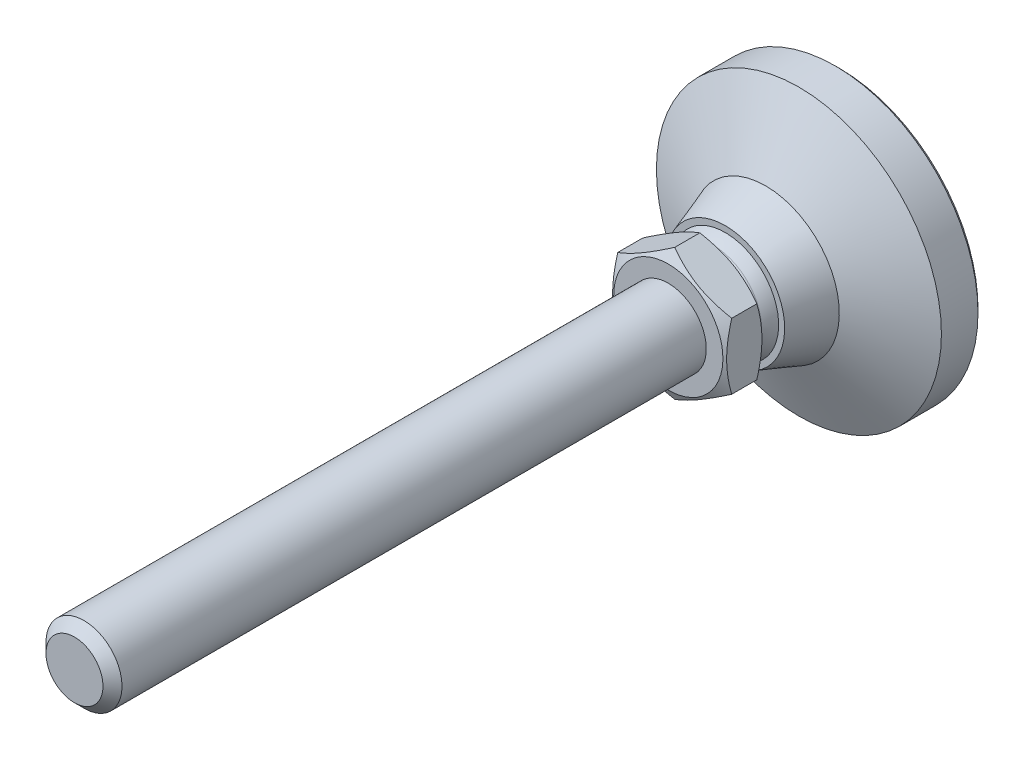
ISO-10303-21;
HEADER;
FILE_DESCRIPTION(('STEP AP214'),'2;1');
FILE_NAME('part.step','',(''),(''),'','','');
FILE_SCHEMA(('AUTOMOTIVE_DESIGN { 1 0 10303 214 1 1 1 1 }'));
ENDSEC;
DATA;
#1=APPLICATION_CONTEXT('core data for automotive mechanical design processes');
#2=APPLICATION_PROTOCOL_DEFINITION('international standard','automotive_design',2000,#1);
#3=PRODUCT_CONTEXT('',#1,'mechanical');
#4=PRODUCT('Part','Part','',(#3));
#5=PRODUCT_RELATED_PRODUCT_CATEGORY('part','',(#4));
#6=PRODUCT_DEFINITION_FORMATION('','',#4);
#7=PRODUCT_DEFINITION_CONTEXT('part definition',#1,'design');
#8=PRODUCT_DEFINITION('design','',#6,#7);
#9=PRODUCT_DEFINITION_SHAPE('','',#8);
#10=(LENGTH_UNIT() NAMED_UNIT(*) SI_UNIT(.MILLI.,.METRE.));
#11=(NAMED_UNIT(*) PLANE_ANGLE_UNIT() SI_UNIT($,.RADIAN.));
#12=(NAMED_UNIT(*) SI_UNIT($,.STERADIAN.) SOLID_ANGLE_UNIT());
#13=UNCERTAINTY_MEASURE_WITH_UNIT(LENGTH_MEASURE(1.E-05),#10,'distance_accuracy_value','');
#14=(GEOMETRIC_REPRESENTATION_CONTEXT(3) GLOBAL_UNCERTAINTY_ASSIGNED_CONTEXT((#13)) GLOBAL_UNIT_ASSIGNED_CONTEXT((#10,
#11,#12)) REPRESENTATION_CONTEXT('',''));
#15=CARTESIAN_POINT('',(0.,0.,0.));
#16=DIRECTION('',(0.,0.,1.));
#17=DIRECTION('',(1.,0.,0.));
#18=AXIS2_PLACEMENT_3D('',#15,#16,#17);
#19=CARTESIAN_POINT('',(-11.0000001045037,0.,27.9999999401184));
#20=DIRECTION('',(0.,0.,1.));
#21=DIRECTION('',(0.,-1.,0.));
#22=AXIS2_PLACEMENT_3D('',#19,#20,#21);
#23=PLANE('',#22);
#24=CARTESIAN_POINT('',(0.,0.,27.9999999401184));
#25=DIRECTION('',(0.,0.,-1.));
#26=DIRECTION('',(0.,1.,0.));
#27=AXIS2_PLACEMENT_3D('',#24,#25,#26);
#28=CIRCLE('',#27,11.5);
#29=CARTESIAN_POINT('',(0.,11.5,27.9999999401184));
#30=VERTEX_POINT('',#29);
#31=EDGE_CURVE('E79',#30,#30,#28,.T.);
#32=ORIENTED_EDGE('',*,*,#31,.T.);
#33=EDGE_LOOP('',(#32));
#34=FACE_BOUND('',#33,.T.);
#35=CARTESIAN_POINT('',(0.,0.,27.9999999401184));
#36=DIRECTION('',(0.,0.,-1.));
#37=DIRECTION('',(0.,1.,0.));
#38=AXIS2_PLACEMENT_3D('',#35,#36,#37);
#39=CIRCLE('',#38,11.0000001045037);
#40=CARTESIAN_POINT('',(0.,11.0000001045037,27.9999999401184));
#41=VERTEX_POINT('',#40);
#42=EDGE_CURVE('E73',#41,#41,#39,.T.);
#43=ORIENTED_EDGE('',*,*,#42,.F.);
#44=EDGE_LOOP('',(#43));
#45=FACE_BOUND('',#44,.T.);
#46=ADVANCED_FACE('F14',(#34,#45),#23,.F.);
#47=CARTESIAN_POINT('',(0.,0.,27.0000000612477));
#48=DIRECTION('',(0.,0.,-1.));
#49=DIRECTION('',(0.,1.,0.));
#50=AXIS2_PLACEMENT_3D('',#47,#48,#49);
#51=TOROIDAL_SURFACE('',#50,11.0000001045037,0.999999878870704);
#52=CARTESIAN_POINT('',(0.,0.,26.4943613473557));
#53=DIRECTION('',(0.,0.,-1.));
#54=DIRECTION('',(0.,1.,0.));
#55=AXIS2_PLACEMENT_3D('',#52,#53,#54);
#56=CIRCLE('',#55,10.1372549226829);
#57=CARTESIAN_POINT('',(-10.1372549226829,0.,26.4943613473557));
#58=VERTEX_POINT('',#57);
#59=EDGE_CURVE('E123',#58,#58,#56,.T.);
#60=ORIENTED_EDGE('',*,*,#59,.F.);
#61=EDGE_LOOP('',(#60));
#62=FACE_BOUND('',#61,.T.);
#63=ORIENTED_EDGE('',*,*,#42,.T.);
#64=EDGE_LOOP('',(#63));
#65=FACE_BOUND('',#64,.T.);
#66=ADVANCED_FACE('F232',(#62,#65),#51,.F.);
#67=CARTESIAN_POINT('',(0.,0.,20.553102));
#68=DIRECTION('',(0.,0.,-1.));
#69=DIRECTION('',(-1.,0.,0.));
#70=AXIS2_PLACEMENT_3D('',#67,#68,#69);
#71=SPHERICAL_SURFACE('',#70,11.75);
#72=CARTESIAN_POINT('',(0.,0.,24.0000004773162));
#73=DIRECTION('',(0.,0.,-1.));
#74=DIRECTION('',(0.,1.,0.));
#75=AXIS2_PLACEMENT_3D('',#72,#73,#74);
#76=CIRCLE('',#75,11.2330490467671);
#77=CARTESIAN_POINT('',(-11.2330490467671,0.,24.0000004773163));
#78=VERTEX_POINT('',#77);
#79=EDGE_CURVE('E120',#78,#78,#76,.T.);
#80=CARTESIAN_POINT('',(-11.2330490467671,0.,24.0000004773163));
#81=CARTESIAN_POINT('',(-11.2247050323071,0.,24.0271926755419));
#82=CARTESIAN_POINT('',(-11.2162622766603,0.,24.0543545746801));
#83=CARTESIAN_POINT('',(-11.1991797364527,0.,24.1086163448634));
#84=CARTESIAN_POINT('',(-11.190539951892,0.,24.1357162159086));
#85=CARTESIAN_POINT('',(-11.1730638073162,0.,24.1898524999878));
#86=CARTESIAN_POINT('',(-11.1642274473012,0.,24.2168889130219));
#87=CARTESIAN_POINT('',(-11.1463586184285,0.,24.2708968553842));
#88=CARTESIAN_POINT('',(-11.1373261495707,0.,24.2978683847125));
#89=CARTESIAN_POINT('',(-11.1190655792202,0.,24.3517451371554));
#90=CARTESIAN_POINT('',(-11.1098374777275,0.,24.3786503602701));
#91=CARTESIAN_POINT('',(-11.0911861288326,0.,24.4323930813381));
#92=CARTESIAN_POINT('',(-11.0817628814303,0.,24.4592305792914));
#93=CARTESIAN_POINT('',(-11.0627217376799,0.,24.5128364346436));
#94=CARTESIAN_POINT('',(-11.0531038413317,0.,24.5396047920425));
#95=CARTESIAN_POINT('',(-11.0336739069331,0.,24.593070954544));
#96=CARTESIAN_POINT('',(-11.0238618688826,0.,24.6197687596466));
#97=CARTESIAN_POINT('',(-11.0040441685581,0.,24.6730924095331));
#98=CARTESIAN_POINT('',(-10.994038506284,0.,24.699718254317));
#99=CARTESIAN_POINT('',(-10.9738340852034,0.,24.7528965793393));
#100=CARTESIAN_POINT('',(-10.963635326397,0.,24.7794490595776));
#101=CARTESIAN_POINT('',(-10.9430452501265,0.,24.832479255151));
#102=CARTESIAN_POINT('',(-10.9326539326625,0.,24.858956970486));
#103=CARTESIAN_POINT('',(-10.9116792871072,0.,24.911836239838));
#104=CARTESIAN_POINT('',(-10.9010959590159,0.,24.938237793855));
#105=CARTESIAN_POINT('',(-10.8797378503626,0.,24.9909633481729));
#106=CARTESIAN_POINT('',(-10.8689630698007,0.,25.0172873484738));
#107=CARTESIAN_POINT('',(-10.8472226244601,0.,25.0698564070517));
#108=CARTESIAN_POINT('',(-10.8362569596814,0.,25.0961014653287));
#109=CARTESIAN_POINT('',(-10.8141353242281,0.,25.1485112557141));
#110=CARTESIAN_POINT('',(-10.8029793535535,0.,25.1746759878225));
#111=CARTESIAN_POINT('',(-10.7804776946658,0.,25.2269237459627));
#112=CARTESIAN_POINT('',(-10.7691320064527,0.,25.2530067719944));
#113=CARTESIAN_POINT('',(-10.7462515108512,0.,25.3050897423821));
#114=CARTESIAN_POINT('',(-10.7347167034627,0.,25.331089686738));
#115=CARTESIAN_POINT('',(-10.7114585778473,0.,25.3830051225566));
#116=CARTESIAN_POINT('',(-10.6997352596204,0.,25.4089206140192));
#117=CARTESIAN_POINT('',(-10.6761007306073,0.,25.4606657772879));
#118=CARTESIAN_POINT('',(-10.6641895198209,0.,25.4864954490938));
#119=CARTESIAN_POINT('',(-10.6401798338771,0.,25.5380676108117));
#120=CARTESIAN_POINT('',(-10.6280813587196,0.,25.5638101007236));
#121=CARTESIAN_POINT('',(-10.6036977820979,0.,25.6152065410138));
#122=CARTESIAN_POINT('',(-10.5914126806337,0.,25.6408604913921));
#123=CARTESIAN_POINT('',(-10.5666564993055,0.,25.6920784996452));
#124=CARTESIAN_POINT('',(-10.5541854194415,0.,25.71764255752));
#125=CARTESIAN_POINT('',(-10.5290579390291,0.,25.768679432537));
#126=CARTESIAN_POINT('',(-10.5164015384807,0.,25.7941522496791));
#127=CARTESIAN_POINT('',(-10.4909040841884,0.,25.8450052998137));
#128=CARTESIAN_POINT('',(-10.4780630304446,0.,25.8703855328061));
#129=CARTESIAN_POINT('',(-10.4521969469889,0.,25.9210520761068));
#130=CARTESIAN_POINT('',(-10.439171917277,0.,25.946338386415));
#131=CARTESIAN_POINT('',(-10.4129385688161,0.,25.9968157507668));
#132=CARTESIAN_POINT('',(-10.3997302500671,0.,26.0220068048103));
#133=CARTESIAN_POINT('',(-10.3731310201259,0.,26.072292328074));
#134=CARTESIAN_POINT('',(-10.3597401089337,0.,26.0973867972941));
#135=CARTESIAN_POINT('',(-10.3327764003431,0.,26.1474778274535));
#136=CARTESIAN_POINT('',(-10.3192036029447,0.,26.1724743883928));
#137=CARTESIAN_POINT('',(-10.2918768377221,0.,26.2223682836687));
#138=CARTESIAN_POINT('',(-10.2781228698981,0.,26.2472656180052));
#139=CARTESIAN_POINT('',(-10.2504344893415,0.,26.2969597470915));
#140=CARTESIAN_POINT('',(-10.2365000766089,0.,26.3217565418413));
#141=CARTESIAN_POINT('',(-10.2084515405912,0.,26.3712482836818));
#142=CARTESIAN_POINT('',(-10.1943374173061,0.,26.3959432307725));
#143=CARTESIAN_POINT('',(-10.1659302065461,0.,26.4452299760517));
#144=CARTESIAN_POINT('',(-10.1516371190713,0.,26.4698217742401));
#145=CARTESIAN_POINT('',(-10.1372549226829,0.,26.4943613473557));
#146=B_SPLINE_CURVE_WITH_KNOTS('',3,(#80,#81,#82,#83,#84,#85,#86,#87,#88,#89,#90,#91,#92,#93,
#94,#95,#96,#97,#98,#99,#100,#101,#102,#103,#104,#105,#106,#107,#108,#109,#110,#111,#112,#113,
#114,#115,#116,#117,#118,#119,#120,#121,#122,#123,#124,#125,#126,#127,#128,#129,#130,#131,#132,
#133,#134,#135,#136,#137,#138,#139,#140,#141,#142,#143,#144,#145),.UNSPECIFIED.,.F.,.F.,(4,2,2,
2,2,2,2,2,2,2,2,2,2,2,2,2,2,2,2,2,2,2,2,2,2,2,2,2,2,2,2,2,4),(0.,0.0853306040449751,
0.170661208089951,0.255991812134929,0.341322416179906,0.426653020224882,0.511983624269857,
0.597314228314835,0.68264483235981,0.767975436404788,0.853306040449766,0.938636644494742,
1.02396724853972,1.1092978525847,1.19462845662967,1.27995906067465,1.36528966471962,
1.4506202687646,1.53595087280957,1.62128147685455,1.70661208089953,1.79194268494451,
1.87727328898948,1.96260389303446,2.04793449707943,2.13326510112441,2.21859570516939,
2.30392630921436,2.38925691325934,2.47458751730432,2.55991812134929,2.64524872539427,
2.73057932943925),.UNSPECIFIED.);
#147=EDGE_CURVE('BSEAM238',#78,#58,#146,.T.);
#148=ORIENTED_EDGE('',*,*,#79,.F.);
#149=ORIENTED_EDGE('',*,*,#59,.T.);
#150=ORIENTED_EDGE('',*,*,#147,.T.);
#151=ORIENTED_EDGE('',*,*,#147,.F.);
#152=EDGE_LOOP('',(#148,#150,#149,#151));
#153=FACE_BOUND('',#152,.T.);
#154=ADVANCED_FACE('F238',(#153),#71,.T.);
#155=CARTESIAN_POINT('',(-11.2330490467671,0.,24.0000004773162));
#156=DIRECTION('',(0.,0.,-1.));
#157=DIRECTION('',(0.,1.,0.));
#158=AXIS2_PLACEMENT_3D('',#155,#156,#157);
#159=PLANE('',#158);
#160=CARTESIAN_POINT('',(0.,0.,24.));
#161=DIRECTION('',(0.,0.,-1.));
#162=DIRECTION('',(0.,1.,0.));
#163=AXIS2_PLACEMENT_3D('',#160,#161,#162);
#164=CIRCLE('',#163,12.5);
#165=CARTESIAN_POINT('',(0.,12.5,24.));
#166=VERTEX_POINT('',#165);
#167=EDGE_CURVE('E117',#166,#166,#164,.T.);
#168=ORIENTED_EDGE('',*,*,#167,.F.);
#169=EDGE_LOOP('',(#168));
#170=FACE_BOUND('',#169,.T.);
#171=ORIENTED_EDGE('',*,*,#79,.T.);
#172=EDGE_LOOP('',(#171));
#173=FACE_BOUND('',#172,.T.);
#174=ADVANCED_FACE('F339',(#170,#173),#159,.F.);
#175=CARTESIAN_POINT('',(0.,0.,24.));
#176=DIRECTION('',(0.,0.,-1.));
#177=DIRECTION('',(0.,1.,0.));
#178=AXIS2_PLACEMENT_3D('',#175,#176,#177);
#179=CONICAL_SURFACE('',#178,12.5,0.339292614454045);
#180=CARTESIAN_POINT('',(0.,0.,15.5));
#181=DIRECTION('',(0.,0.,-1.));
#182=DIRECTION('',(0.,1.,0.));
#183=AXIS2_PLACEMENT_3D('',#180,#181,#182);
#184=CIRCLE('',#183,15.5);
#185=CARTESIAN_POINT('',(0.,15.5,15.5));
#186=VERTEX_POINT('',#185);
#187=EDGE_CURVE('E114',#186,#186,#184,.T.);
#188=ORIENTED_EDGE('',*,*,#187,.F.);
#189=EDGE_LOOP('',(#188));
#190=FACE_BOUND('',#189,.T.);
#191=ORIENTED_EDGE('',*,*,#167,.T.);
#192=EDGE_LOOP('',(#191));
#193=FACE_BOUND('',#192,.T.);
#194=ADVANCED_FACE('F348',(#190,#193),#179,.T.);
#195=CARTESIAN_POINT('',(0.,0.,15.5));
#196=DIRECTION('',(0.,0.,-1.));
#197=DIRECTION('',(0.,1.,0.));
#198=AXIS2_PLACEMENT_3D('',#195,#196,#197);
#199=CONICAL_SURFACE('',#198,15.5,1.12103671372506);
#200=CARTESIAN_POINT('',(0.,0.,8.5));
#201=DIRECTION('',(0.,0.,-1.));
#202=DIRECTION('',(0.,1.,0.));
#203=AXIS2_PLACEMENT_3D('',#200,#201,#202);
#204=CIRCLE('',#203,30.);
#205=CARTESIAN_POINT('',(0.,30.,8.5));
#206=VERTEX_POINT('',#205);
#207=EDGE_CURVE('E111',#206,#206,#204,.T.);
#208=ORIENTED_EDGE('',*,*,#207,.F.);
#209=EDGE_LOOP('',(#208));
#210=FACE_BOUND('',#209,.T.);
#211=ORIENTED_EDGE('',*,*,#187,.T.);
#212=EDGE_LOOP('',(#211));
#213=FACE_BOUND('',#212,.T.);
#214=ADVANCED_FACE('F357',(#210,#213),#199,.T.);
#215=CARTESIAN_POINT('',(0.,0.,0.));
#216=DIRECTION('',(0.,0.,-1.));
#217=DIRECTION('',(0.,1.,0.));
#218=AXIS2_PLACEMENT_3D('',#215,#216,#217);
#219=CYLINDRICAL_SURFACE('',#218,30.);
#220=CARTESIAN_POINT('',(0.,0.,0.800000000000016));
#221=DIRECTION('',(0.,0.,-1.));
#222=DIRECTION('',(0.,1.,0.));
#223=AXIS2_PLACEMENT_3D('',#220,#221,#222);
#224=CIRCLE('',#223,30.);
#225=CARTESIAN_POINT('',(0.,30.,0.800000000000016));
#226=VERTEX_POINT('',#225);
#227=EDGE_CURVE('E88',#226,#226,#224,.T.);
#228=ORIENTED_EDGE('',*,*,#227,.F.);
#229=EDGE_LOOP('',(#228));
#230=FACE_BOUND('',#229,.T.);
#231=ORIENTED_EDGE('',*,*,#207,.T.);
#232=EDGE_LOOP('',(#231));
#233=FACE_BOUND('',#232,.T.);
#234=ADVANCED_FACE('F366',(#230,#233),#219,.T.);
#235=CARTESIAN_POINT('',(0.,0.,0.800000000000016));
#236=DIRECTION('',(0.,0.,1.));
#237=DIRECTION('',(0.,-1.,0.));
#238=AXIS2_PLACEMENT_3D('',#235,#236,#237);
#239=CONICAL_SURFACE('',#238,30.,0.785398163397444);
#240=CARTESIAN_POINT('',(0.,0.,0.));
#241=DIRECTION('',(0.,0.,-1.));
#242=DIRECTION('',(0.,1.,0.));
#243=AXIS2_PLACEMENT_3D('',#240,#241,#242);
#244=CIRCLE('',#243,29.2);
#245=CARTESIAN_POINT('',(0.,29.2,0.));
#246=VERTEX_POINT('',#245);
#247=EDGE_CURVE('E85',#246,#246,#244,.T.);
#248=ORIENTED_EDGE('',*,*,#247,.F.);
#249=EDGE_LOOP('',(#248));
#250=FACE_BOUND('',#249,.T.);
#251=ORIENTED_EDGE('',*,*,#227,.T.);
#252=EDGE_LOOP('',(#251));
#253=FACE_BOUND('',#252,.T.);
#254=ADVANCED_FACE('F329',(#250,#253),#239,.T.);
#255=CARTESIAN_POINT('',(0.,0.,0.));
#256=DIRECTION('',(0.,0.,1.));
#257=DIRECTION('',(0.,-1.,0.));
#258=AXIS2_PLACEMENT_3D('',#255,#256,#257);
#259=PLANE('',#258);
#260=ORIENTED_EDGE('',*,*,#247,.T.);
#261=EDGE_LOOP('',(#260));
#262=FACE_BOUND('',#261,.T.);
#263=ADVANCED_FACE('F141',(#262),#259,.F.);
#264=CARTESIAN_POINT('',(0.,0.,31.2380286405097));
#265=DIRECTION('',(0.,0.,1.));
#266=DIRECTION('',(0.,-1.,0.));
#267=AXIS2_PLACEMENT_3D('',#264,#265,#266);
#268=CONICAL_SURFACE('',#267,17.1084302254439,1.0471975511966);
#269=CARTESIAN_POINT('',(-12.0002,6.92808776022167,29.3605385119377));
#270=CARTESIAN_POINT('',(-11.7364142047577,7.08038456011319,29.2726247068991));
#271=CARTESIAN_POINT('',(-11.4716448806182,7.23324920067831,29.1887010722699));
#272=CARTESIAN_POINT('',(-10.9399829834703,7.54020434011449,29.029941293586));
#273=CARTESIAN_POINT('',(-10.6730897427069,7.69429522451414,28.9551081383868));
#274=CARTESIAN_POINT('',(-9.868109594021,8.15905073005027,28.7456926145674));
#275=CARTESIAN_POINT('',(-9.32684492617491,8.47155003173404,28.6265783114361));
#276=CARTESIAN_POINT('',(-8.51686717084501,8.93919090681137,28.4869061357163));
#277=CARTESIAN_POINT('',(-8.25057389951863,9.09293539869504,28.4471188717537));
#278=CARTESIAN_POINT('',(-7.71675440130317,9.40113622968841,28.3803984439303));
#279=CARTESIAN_POINT('',(-7.44922815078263,9.55559258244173,28.353465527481));
#280=CARTESIAN_POINT('',(-6.91372963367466,9.86476279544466,28.3131436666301));
#281=CARTESIAN_POINT('',(-6.64575827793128,10.0194761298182,28.2997386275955));
#282=CARTESIAN_POINT('',(-6.10956726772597,10.3290461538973,28.2867581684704));
#283=CARTESIAN_POINT('',(-5.84134762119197,10.4839028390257,28.287182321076));
#284=CARTESIAN_POINT('',(-5.3399106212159,10.7734076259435,28.300895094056));
#285=CARTESIAN_POINT('',(-5.10665750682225,10.908076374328,28.3125110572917));
#286=CARTESIAN_POINT('',(-4.64068775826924,11.1771041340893,28.3459830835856));
#287=CARTESIAN_POINT('',(-4.40797116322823,11.3114631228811,28.3678398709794));
#288=CARTESIAN_POINT('',(-3.94320092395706,11.5797983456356,28.4214124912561));
#289=CARTESIAN_POINT('',(-3.711147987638,11.7137741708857,28.4531364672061));
#290=CARTESIAN_POINT('',(-3.24813003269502,11.9810977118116,28.5258868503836));
#291=CARTESIAN_POINT('',(-3.01716508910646,12.1144453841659,28.5669138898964));
#292=CARTESIAN_POINT('',(-2.31605804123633,12.5192297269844,28.704986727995));
#293=CARTESIAN_POINT('',(-1.84794625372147,12.789494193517,28.8157999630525));
#294=CARTESIAN_POINT('',(-0.918702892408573,13.3259930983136,29.0673008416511));
#295=CARTESIAN_POINT('',(-0.457559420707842,13.5922344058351,29.2079294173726));
#296=CARTESIAN_POINT('',(0.000200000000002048,13.8565219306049,29.3605385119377));
#297=B_SPLINE_CURVE_WITH_KNOTS('',3,(#269,#270,#271,#272,#273,#274,#275,#276,#277,#278,#279,
#280,#281,#282,#283,#284,#285,#286,#287,#288,#289,#290,#291,#292,#293,#294,#295,#296),
.UNSPECIFIED.,.F.,.F.,(4,2,2,2,2,2,2,2,2,2,2,2,2,4),(0.,0.951004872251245,1.90232158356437,
3.80900466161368,4.7389455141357,5.66890426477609,6.59775529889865,7.5265776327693,
8.33514643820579,9.1437724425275,9.95306755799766,10.7624176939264,12.4167102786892,
14.0677556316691),.UNSPECIFIED.);
#298=CARTESIAN_POINT('',(-12.,6.92820323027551,29.3604718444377));
#299=VERTEX_POINT('',#298);
#300=CARTESIAN_POINT('',(0.,13.856406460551,29.3604718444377));
#301=VERTEX_POINT('',#300);
#302=EDGE_CURVE('E29',#299,#301,#297,.T.);
#303=ORIENTED_EDGE('',*,*,#302,.T.);
#304=CARTESIAN_POINT('',(-0.000199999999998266,13.8565219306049,29.3605385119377));
#305=CARTESIAN_POINT('',(0.263585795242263,13.7042251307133,29.2726247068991));
#306=CARTESIAN_POINT('',(0.528355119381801,13.5513604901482,29.1887010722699));
#307=CARTESIAN_POINT('',(1.06001701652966,13.244405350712,29.0299412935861));
#308=CARTESIAN_POINT('',(1.32691025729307,13.0903144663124,28.9551081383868));
#309=CARTESIAN_POINT('',(2.13189040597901,12.6255589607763,28.7456926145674));
#310=CARTESIAN_POINT('',(2.6731550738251,12.3130596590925,28.6265783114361));
#311=CARTESIAN_POINT('',(3.483132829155,11.8454187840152,28.4869061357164));
#312=CARTESIAN_POINT('',(3.74942610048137,11.6916742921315,28.4471188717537));
#313=CARTESIAN_POINT('',(4.28324559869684,11.3834734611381,28.3803984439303));
#314=CARTESIAN_POINT('',(4.55077184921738,11.2290171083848,28.353465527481));
#315=CARTESIAN_POINT('',(5.08627036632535,10.9198468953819,28.3131436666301));
#316=CARTESIAN_POINT('',(5.35424172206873,10.7651335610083,28.2997386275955));
#317=CARTESIAN_POINT('',(5.89043273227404,10.4555635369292,28.2867581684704));
#318=CARTESIAN_POINT('',(6.15865237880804,10.3007068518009,28.287182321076));
#319=CARTESIAN_POINT('',(6.66008937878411,10.0112020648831,28.300895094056));
#320=CARTESIAN_POINT('',(6.89334249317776,9.87653331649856,28.3125110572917));
#321=CARTESIAN_POINT('',(7.35931224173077,9.60750555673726,28.3459830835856));
#322=CARTESIAN_POINT('',(7.59202883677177,9.47314656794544,28.3678398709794));
#323=CARTESIAN_POINT('',(8.05679907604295,9.20481134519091,28.4214124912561));
#324=CARTESIAN_POINT('',(8.28885201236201,9.07083551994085,28.4531364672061));
#325=CARTESIAN_POINT('',(8.75186996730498,8.8035119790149,28.5258868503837));
#326=CARTESIAN_POINT('',(8.98283491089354,8.67016430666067,28.5669138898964));
#327=CARTESIAN_POINT('',(9.68394195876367,8.26537996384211,28.704986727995));
#328=CARTESIAN_POINT('',(10.1520537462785,7.99511549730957,28.8157999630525));
#329=CARTESIAN_POINT('',(11.0812971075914,7.4586165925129,29.0673008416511));
#330=CARTESIAN_POINT('',(11.5424405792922,7.19237528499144,29.2079294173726));
#331=CARTESIAN_POINT('',(12.0002,6.92808776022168,29.3605385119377));
#332=B_SPLINE_CURVE_WITH_KNOTS('',3,(#304,#305,#306,#307,#308,#309,#310,#311,#312,#313,#314,
#315,#316,#317,#318,#319,#320,#321,#322,#323,#324,#325,#326,#327,#328,#329,#330,#331),
.UNSPECIFIED.,.F.,.F.,(4,2,2,2,2,2,2,2,2,2,2,2,2,4),(0.,0.951004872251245,1.90232158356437,
3.80900466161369,4.7389455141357,5.66890426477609,6.59775529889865,7.5265776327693,
8.33514643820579,9.14377244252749,9.95306755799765,10.7624176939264,12.4167102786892,
14.0677556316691),.UNSPECIFIED.);
#333=CARTESIAN_POINT('',(12.,6.92820323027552,29.3604718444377));
#334=VERTEX_POINT('',#333);
#335=EDGE_CURVE('E66',#301,#334,#332,.T.);
#336=ORIENTED_EDGE('',*,*,#335,.T.);
#337=CARTESIAN_POINT('',(12.,18.5959139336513,34.138160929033));
#338=CARTESIAN_POINT('',(12.,18.3339211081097,34.0110670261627));
#339=CARTESIAN_POINT('',(12.,18.0716204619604,33.8846079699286));
#340=CARTESIAN_POINT('',(12.,17.5463392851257,33.6331033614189));
#341=CARTESIAN_POINT('',(12.,17.283358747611,33.5080578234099));
#342=CARTESIAN_POINT('',(12.,16.49323070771,33.135224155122));
#343=CARTESIAN_POINT('',(12.,15.9649744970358,32.8897767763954));
#344=CARTESIAN_POINT('',(12.,14.9020407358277,32.4052865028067));
#345=CARTESIAN_POINT('',(12.,14.3673438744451,32.16628587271));
#346=CARTESIAN_POINT('',(12.,13.2936929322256,31.6980804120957));
#347=CARTESIAN_POINT('',(12.,12.7547390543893,31.4688751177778));
#348=CARTESIAN_POINT('',(12.,11.6543820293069,31.0157139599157));
#349=CARTESIAN_POINT('',(12.,11.0928122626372,30.792160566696));
#350=CARTESIAN_POINT('',(12.,9.96309356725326,30.362006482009));
#351=CARTESIAN_POINT('',(12.,9.39494390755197,30.1554076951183));
#352=CARTESIAN_POINT('',(12.,8.25224805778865,29.7645997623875));
#353=CARTESIAN_POINT('',(12.,7.67771753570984,29.580345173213));
#354=CARTESIAN_POINT('',(12.,6.52036068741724,29.2401370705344));
#355=CARTESIAN_POINT('',(12.,5.93753704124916,29.0841746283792));
#356=CARTESIAN_POINT('',(12.,5.05858991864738,28.8775260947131));
#357=CARTESIAN_POINT('',(12.,4.76562339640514,28.8133299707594));
#358=CARTESIAN_POINT('',(12.,4.17769116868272,28.6948027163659));
#359=CARTESIAN_POINT('',(12.,3.88272550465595,28.6404713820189));
#360=CARTESIAN_POINT('',(12.,3.29099923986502,28.5426335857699));
#361=CARTESIAN_POINT('',(12.,2.99423866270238,28.4991269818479));
#362=CARTESIAN_POINT('',(12.,2.39923843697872,28.423807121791));
#363=CARTESIAN_POINT('',(12.,2.10099884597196,28.3919934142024));
#364=CARTESIAN_POINT('',(12.,1.50734547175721,28.3410894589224));
#365=CARTESIAN_POINT('',(12.,1.21194553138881,28.3218387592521));
#366=CARTESIAN_POINT('',(12.,0.620596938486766,28.2958456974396));
#367=CARTESIAN_POINT('',(12.,0.32464829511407,28.2891031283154));
#368=CARTESIAN_POINT('',(12.,-0.267269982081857,28.2882866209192));
#369=CARTESIAN_POINT('',(12.,-0.563239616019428,28.2942127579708));
#370=CARTESIAN_POINT('',(12.,-1.15466616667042,28.3185894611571));
#371=CARTESIAN_POINT('',(12.,-1.45012305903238,28.3370406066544));
#372=CARTESIAN_POINT('',(12.,-2.16061145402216,28.3960795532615));
#373=CARTESIAN_POINT('',(12.,-2.57515591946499,28.4426329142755));
#374=CARTESIAN_POINT('',(12.,-3.40116153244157,28.5578575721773));
#375=CARTESIAN_POINT('',(12.,-3.81262225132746,28.6265318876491));
#376=CARTESIAN_POINT('',(12.,-4.63206995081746,28.7835554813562));
#377=CARTESIAN_POINT('',(12.,-5.04005395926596,28.8719201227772));
#378=CARTESIAN_POINT('',(12.,-5.85192616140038,29.0656288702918));
#379=CARTESIAN_POINT('',(12.,-6.2558144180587,29.1709727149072));
#380=CARTESIAN_POINT('',(12.,-7.06839401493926,29.3985720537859));
#381=CARTESIAN_POINT('',(12.,-7.47699453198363,29.5211495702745));
#382=CARTESIAN_POINT('',(12.,-8.2901700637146,29.7789324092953));
#383=CARTESIAN_POINT('',(12.,-8.69474505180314,29.9141378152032));
#384=CARTESIAN_POINT('',(12.,-9.5000704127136,30.1950328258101));
#385=CARTESIAN_POINT('',(12.,-9.90082201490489,30.3407189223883));
#386=CARTESIAN_POINT('',(12.,-10.6990065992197,30.6408649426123));
#387=CARTESIAN_POINT('',(12.,-11.096439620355,30.7953247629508));
#388=CARTESIAN_POINT('',(12.,-12.0350382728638,31.1701326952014));
#389=CARTESIAN_POINT('',(12.,-12.5749183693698,31.3936952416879));
#390=CARTESIAN_POINT('',(12.,-13.6500874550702,31.851631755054));
#391=CARTESIAN_POINT('',(12.,-14.1853761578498,32.0860063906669));
#392=CARTESIAN_POINT('',(12.,-15.2522201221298,32.5633973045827));
#393=CARTESIAN_POINT('',(12.,-15.7837745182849,32.8064155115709));
#394=CARTESIAN_POINT('',(12.,-16.8436550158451,33.2993463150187));
#395=CARTESIAN_POINT('',(12.,-17.3719811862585,33.5492587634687));
#396=CARTESIAN_POINT('',(12.,-18.4265201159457,34.0549637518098));
#397=CARTESIAN_POINT('',(12.,-18.9527299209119,34.3107624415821));
#398=CARTESIAN_POINT('',(12.,-20.0028840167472,34.8269679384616));
#399=CARTESIAN_POINT('',(12.,-20.5268282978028,35.0873747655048));
#400=CARTESIAN_POINT('',(12.,-21.5727325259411,35.6119714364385));
#401=CARTESIAN_POINT('',(12.,-22.0946927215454,35.8761607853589));
#402=CARTESIAN_POINT('',(12.,-23.1369838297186,36.4077358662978));
#403=CARTESIAN_POINT('',(12.,-23.6573147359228,36.675121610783));
#404=CARTESIAN_POINT('',(12.,-25.1288566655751,37.4361233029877));
#405=CARTESIAN_POINT('',(12.,-26.0784324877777,37.9329011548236));
#406=CARTESIAN_POINT('',(12.,-27.9740672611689,38.9331872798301));
#407=CARTESIAN_POINT('',(12.,-28.9201260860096,39.4366957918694));
#408=CARTESIAN_POINT('',(12.,-30.8071310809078,40.447604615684));
#409=CARTESIAN_POINT('',(12.,-31.7480841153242,40.9549921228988));
#410=CARTESIAN_POINT('',(12.,-33.1578554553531,41.7190678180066));
#411=CARTESIAN_POINT('',(12.,-33.6274902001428,41.974251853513));
#412=CARTESIAN_POINT('',(12.,-34.5662695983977,42.4855181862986));
#413=CARTESIAN_POINT('',(12.,-35.0354142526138,42.7416004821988));
#414=CARTESIAN_POINT('',(12.,-35.5043416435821,42.9980801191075));
#415=B_SPLINE_CURVE_WITH_KNOTS('',3,(#337,#338,#339,#340,#341,#342,#343,#344,#345,#346,#347,
#348,#349,#350,#351,#352,#353,#354,#355,#356,#357,#358,#359,#360,#361,#362,#363,#364,#365,#366,
#367,#368,#369,#370,#371,#372,#373,#374,#375,#376,#377,#378,#379,#380,#381,#382,#383,#384,#385,
#386,#387,#388,#389,#390,#391,#392,#393,#394,#395,#396,#397,#398,#399,#400,#401,#402,#403,#404,
#405,#406,#407,#408,#409,#410,#411,#412,#413,#414),.UNSPECIFIED.,.F.,.F.,(4,2,2,2,2,2,2,2,2,2,2,
2,2,2,2,2,2,2,2,2,2,2,2,2,2,2,2,2,2,2,2,2,2,2,2,2,2,2,4),(0.,0.873576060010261,1.74716092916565,
3.4945899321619,5.25155587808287,7.00843854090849,8.82152224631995,10.6348093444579,
12.4443444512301,14.2533074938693,15.1529208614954,16.0525156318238,16.952098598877,
17.8516468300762,18.7394689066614,19.6272762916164,20.5150889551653,21.402942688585,
22.6537010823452,23.9046302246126,25.1565388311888,26.4084281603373,27.6879562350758,
28.9674927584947,30.2466029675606,31.5256981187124,33.2785515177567,35.0315134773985,
36.7848690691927,38.5381870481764,40.2934284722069,42.0486774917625,43.8036988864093,
45.5587271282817,48.7737044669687,51.9887962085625,55.1958863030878,56.7993447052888,
58.4028006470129),.UNSPECIFIED.);
#416=CARTESIAN_POINT('',(12.,-6.92820323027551,29.3604718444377));
#417=VERTEX_POINT('',#416);
#418=EDGE_CURVE('E69',#334,#417,#415,.T.);
#419=ORIENTED_EDGE('',*,*,#418,.T.);
#420=CARTESIAN_POINT('',(12.0002,-6.92808776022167,29.3605385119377));
#421=CARTESIAN_POINT('',(11.7364142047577,-7.08038456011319,29.2726247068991));
#422=CARTESIAN_POINT('',(11.4716448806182,-7.23324920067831,29.1887010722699));
#423=CARTESIAN_POINT('',(10.9399829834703,-7.54020434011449,29.029941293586));
#424=CARTESIAN_POINT('',(10.6730897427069,-7.69429522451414,28.9551081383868));
#425=CARTESIAN_POINT('',(9.868109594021,-8.15905073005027,28.7456926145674));
#426=CARTESIAN_POINT('',(9.32684492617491,-8.47155003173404,28.6265783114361));
#427=CARTESIAN_POINT('',(8.51686717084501,-8.93919090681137,28.4869061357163));
#428=CARTESIAN_POINT('',(8.25057389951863,-9.09293539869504,28.4471188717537));
#429=CARTESIAN_POINT('',(7.71675440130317,-9.40113622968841,28.3803984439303));
#430=CARTESIAN_POINT('',(7.44922815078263,-9.55559258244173,28.353465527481));
#431=CARTESIAN_POINT('',(6.91372963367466,-9.86476279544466,28.3131436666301));
#432=CARTESIAN_POINT('',(6.64575827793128,-10.0194761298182,28.2997386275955));
#433=CARTESIAN_POINT('',(6.10956726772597,-10.3290461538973,28.2867581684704));
#434=CARTESIAN_POINT('',(5.84134762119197,-10.4839028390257,28.287182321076));
#435=CARTESIAN_POINT('',(5.3399106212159,-10.7734076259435,28.300895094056));
#436=CARTESIAN_POINT('',(5.10665750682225,-10.908076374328,28.3125110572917));
#437=CARTESIAN_POINT('',(4.64068775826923,-11.1771041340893,28.3459830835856));
#438=CARTESIAN_POINT('',(4.40797116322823,-11.3114631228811,28.3678398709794));
#439=CARTESIAN_POINT('',(3.94320092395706,-11.5797983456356,28.4214124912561));
#440=CARTESIAN_POINT('',(3.711147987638,-11.7137741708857,28.4531364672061));
#441=CARTESIAN_POINT('',(3.24813003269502,-11.9810977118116,28.5258868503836));
#442=CARTESIAN_POINT('',(3.01716508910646,-12.1144453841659,28.5669138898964));
#443=CARTESIAN_POINT('',(2.31605804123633,-12.5192297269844,28.704986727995));
#444=CARTESIAN_POINT('',(1.84794625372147,-12.789494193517,28.8157999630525));
#445=CARTESIAN_POINT('',(0.918702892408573,-13.3259930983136,29.0673008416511));
#446=CARTESIAN_POINT('',(0.457559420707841,-13.5922344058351,29.2079294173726));
#447=CARTESIAN_POINT('',(-0.000200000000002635,-13.8565219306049,29.3605385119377));
#448=B_SPLINE_CURVE_WITH_KNOTS('',3,(#420,#421,#422,#423,#424,#425,#426,#427,#428,#429,#430,
#431,#432,#433,#434,#435,#436,#437,#438,#439,#440,#441,#442,#443,#444,#445,#446,#447),
.UNSPECIFIED.,.F.,.F.,(4,2,2,2,2,2,2,2,2,2,2,2,2,4),(0.,0.951004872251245,1.90232158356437,
3.80900466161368,4.7389455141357,5.66890426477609,6.59775529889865,7.5265776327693,
8.33514643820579,9.1437724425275,9.95306755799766,10.7624176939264,12.4167102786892,
14.0677556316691),.UNSPECIFIED.);
#449=CARTESIAN_POINT('',(0.,-13.856406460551,29.3604718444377));
#450=VERTEX_POINT('',#449);
#451=EDGE_CURVE('E78',#417,#450,#448,.T.);
#452=ORIENTED_EDGE('',*,*,#451,.T.);
#453=CARTESIAN_POINT('',(0.000199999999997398,-13.8565219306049,29.3605385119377));
#454=CARTESIAN_POINT('',(-0.26358579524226,-13.7042251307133,29.2726247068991));
#455=CARTESIAN_POINT('',(-0.528355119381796,-13.5513604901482,29.1887010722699));
#456=CARTESIAN_POINT('',(-1.06001701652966,-13.244405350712,29.029941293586));
#457=CARTESIAN_POINT('',(-1.32691025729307,-13.0903144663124,28.9551081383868));
#458=CARTESIAN_POINT('',(-2.13189040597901,-12.6255589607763,28.7456926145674));
#459=CARTESIAN_POINT('',(-2.6731550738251,-12.3130596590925,28.6265783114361));
#460=CARTESIAN_POINT('',(-3.48313282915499,-11.8454187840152,28.4869061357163));
#461=CARTESIAN_POINT('',(-3.74942610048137,-11.6916742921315,28.4471188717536));
#462=CARTESIAN_POINT('',(-4.28324559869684,-11.3834734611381,28.3803984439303));
#463=CARTESIAN_POINT('',(-4.55077184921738,-11.2290171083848,28.353465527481));
#464=CARTESIAN_POINT('',(-5.08627036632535,-10.9198468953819,28.3131436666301));
#465=CARTESIAN_POINT('',(-5.35424172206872,-10.7651335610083,28.2997386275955));
#466=CARTESIAN_POINT('',(-5.89043273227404,-10.4555635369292,28.2867581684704));
#467=CARTESIAN_POINT('',(-6.15865237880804,-10.3007068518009,28.287182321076));
#468=CARTESIAN_POINT('',(-6.66008937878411,-10.0112020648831,28.300895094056));
#469=CARTESIAN_POINT('',(-6.89334249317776,-9.87653331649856,28.3125110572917));
#470=CARTESIAN_POINT('',(-7.35931224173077,-9.60750555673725,28.3459830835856));
#471=CARTESIAN_POINT('',(-7.59202883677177,-9.47314656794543,28.3678398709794));
#472=CARTESIAN_POINT('',(-8.05679907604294,-9.2048113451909,28.4214124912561));
#473=CARTESIAN_POINT('',(-8.288852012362,-9.07083551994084,28.4531364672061));
#474=CARTESIAN_POINT('',(-8.75186996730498,-8.80351197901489,28.5258868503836));
#475=CARTESIAN_POINT('',(-8.98283491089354,-8.67016430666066,28.5669138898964));
#476=CARTESIAN_POINT('',(-9.68394195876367,-8.2653799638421,28.704986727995));
#477=CARTESIAN_POINT('',(-10.1520537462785,-7.99511549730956,28.8157999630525));
#478=CARTESIAN_POINT('',(-11.0812971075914,-7.45861659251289,29.0673008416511));
#479=CARTESIAN_POINT('',(-11.5424405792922,-7.19237528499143,29.2079294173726));
#480=CARTESIAN_POINT('',(-12.0002,-6.92808776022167,29.3605385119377));
#481=B_SPLINE_CURVE_WITH_KNOTS('',3,(#453,#454,#455,#456,#457,#458,#459,#460,#461,#462,#463,
#464,#465,#466,#467,#468,#469,#470,#471,#472,#473,#474,#475,#476,#477,#478,#479,#480),
.UNSPECIFIED.,.F.,.F.,(4,2,2,2,2,2,2,2,2,2,2,2,2,4),(0.,0.951004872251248,1.90232158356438,
3.80900466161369,4.7389455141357,5.66890426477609,6.59775529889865,7.5265776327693,
8.33514643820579,9.1437724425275,9.95306755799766,10.7624176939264,12.4167102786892,
14.0677556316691),.UNSPECIFIED.);
#482=CARTESIAN_POINT('',(-12.,-6.92820323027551,29.3604718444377));
#483=VERTEX_POINT('',#482);
#484=EDGE_CURVE('E165',#450,#483,#481,.T.);
#485=ORIENTED_EDGE('',*,*,#484,.T.);
#486=CARTESIAN_POINT('',(-12.,18.5959139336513,34.138160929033));
#487=CARTESIAN_POINT('',(-12.,18.3339211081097,34.0110670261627));
#488=CARTESIAN_POINT('',(-12.,18.0716204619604,33.8846079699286));
#489=CARTESIAN_POINT('',(-12.,17.5463392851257,33.6331033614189));
#490=CARTESIAN_POINT('',(-12.,17.283358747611,33.5080578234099));
#491=CARTESIAN_POINT('',(-12.,16.4932307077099,33.135224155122));
#492=CARTESIAN_POINT('',(-12.,15.9649744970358,32.8897767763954));
#493=CARTESIAN_POINT('',(-12.,14.9020407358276,32.4052865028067));
#494=CARTESIAN_POINT('',(-12.,14.3673438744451,32.16628587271));
#495=CARTESIAN_POINT('',(-12.,13.2936929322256,31.6980804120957));
#496=CARTESIAN_POINT('',(-12.,12.7547390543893,31.4688751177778));
#497=CARTESIAN_POINT('',(-12.,11.6543820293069,31.0157139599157));
#498=CARTESIAN_POINT('',(-12.,11.0928122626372,30.792160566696));
#499=CARTESIAN_POINT('',(-12.,9.96309356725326,30.362006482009));
#500=CARTESIAN_POINT('',(-12.,9.39494390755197,30.1554076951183));
#501=CARTESIAN_POINT('',(-12.,8.25224805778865,29.7645997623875));
#502=CARTESIAN_POINT('',(-12.,7.67771753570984,29.580345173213));
#503=CARTESIAN_POINT('',(-12.,6.52036068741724,29.2401370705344));
#504=CARTESIAN_POINT('',(-12.,5.93753704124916,29.0841746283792));
#505=CARTESIAN_POINT('',(-12.,5.05858991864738,28.8775260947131));
#506=CARTESIAN_POINT('',(-12.,4.76562339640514,28.8133299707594));
#507=CARTESIAN_POINT('',(-12.,4.17769116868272,28.6948027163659));
#508=CARTESIAN_POINT('',(-12.,3.88272550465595,28.6404713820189));
#509=CARTESIAN_POINT('',(-12.,3.29099923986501,28.5426335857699));
#510=CARTESIAN_POINT('',(-12.,2.99423866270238,28.4991269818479));
#511=CARTESIAN_POINT('',(-12.,2.39923843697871,28.423807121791));
#512=CARTESIAN_POINT('',(-12.,2.10099884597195,28.3919934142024));
#513=CARTESIAN_POINT('',(-12.,1.5073454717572,28.3410894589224));
#514=CARTESIAN_POINT('',(-12.,1.2119455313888,28.3218387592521));
#515=CARTESIAN_POINT('',(-12.,0.620596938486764,28.2958456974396));
#516=CARTESIAN_POINT('',(-12.,0.324648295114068,28.2891031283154));
#517=CARTESIAN_POINT('',(-12.,-0.26726998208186,28.2882866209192));
#518=CARTESIAN_POINT('',(-12.,-0.563239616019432,28.2942127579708));
#519=CARTESIAN_POINT('',(-12.,-1.15466616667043,28.3185894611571));
#520=CARTESIAN_POINT('',(-12.,-1.45012305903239,28.3370406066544));
#521=CARTESIAN_POINT('',(-12.,-2.16061145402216,28.3960795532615));
#522=CARTESIAN_POINT('',(-12.,-2.57515591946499,28.4426329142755));
#523=CARTESIAN_POINT('',(-12.,-3.40116153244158,28.5578575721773));
#524=CARTESIAN_POINT('',(-12.,-3.81262225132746,28.6265318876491));
#525=CARTESIAN_POINT('',(-12.,-4.63206995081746,28.7835554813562));
#526=CARTESIAN_POINT('',(-12.,-5.04005395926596,28.8719201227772));
#527=CARTESIAN_POINT('',(-12.,-5.85192616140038,29.0656288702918));
#528=CARTESIAN_POINT('',(-12.,-6.2558144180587,29.1709727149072));
#529=CARTESIAN_POINT('',(-12.,-7.06839401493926,29.3985720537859));
#530=CARTESIAN_POINT('',(-12.,-7.47699453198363,29.5211495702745));
#531=CARTESIAN_POINT('',(-12.,-8.2901700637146,29.7789324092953));
#532=CARTESIAN_POINT('',(-12.,-8.69474505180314,29.9141378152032));
#533=CARTESIAN_POINT('',(-12.,-9.5000704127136,30.1950328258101));
#534=CARTESIAN_POINT('',(-12.,-9.90082201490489,30.3407189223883));
#535=CARTESIAN_POINT('',(-12.,-10.6990065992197,30.6408649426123));
#536=CARTESIAN_POINT('',(-12.,-11.096439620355,30.7953247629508));
#537=CARTESIAN_POINT('',(-12.,-12.0350382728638,31.1701326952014));
#538=CARTESIAN_POINT('',(-12.,-12.5749183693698,31.3936952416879));
#539=CARTESIAN_POINT('',(-12.,-13.6500874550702,31.851631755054));
#540=CARTESIAN_POINT('',(-12.,-14.1853761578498,32.0860063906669));
#541=CARTESIAN_POINT('',(-12.,-15.2522201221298,32.5633973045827));
#542=CARTESIAN_POINT('',(-12.,-15.783774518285,32.8064155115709));
#543=CARTESIAN_POINT('',(-12.,-16.8436550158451,33.2993463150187));
#544=CARTESIAN_POINT('',(-12.,-17.3719811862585,33.5492587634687));
#545=CARTESIAN_POINT('',(-12.,-18.4265201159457,34.0549637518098));
#546=CARTESIAN_POINT('',(-12.,-18.9527299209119,34.3107624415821));
#547=CARTESIAN_POINT('',(-12.,-20.0028840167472,34.8269679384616));
#548=CARTESIAN_POINT('',(-12.,-20.5268282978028,35.0873747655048));
#549=CARTESIAN_POINT('',(-12.,-21.5727325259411,35.6119714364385));
#550=CARTESIAN_POINT('',(-12.,-22.0946927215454,35.8761607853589));
#551=CARTESIAN_POINT('',(-12.,-23.1369838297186,36.4077358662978));
#552=CARTESIAN_POINT('',(-12.,-23.6573147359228,36.675121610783));
#553=CARTESIAN_POINT('',(-12.,-25.1288566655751,37.4361233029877));
#554=CARTESIAN_POINT('',(-12.,-26.0784324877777,37.9329011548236));
#555=CARTESIAN_POINT('',(-12.,-27.9740672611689,38.9331872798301));
#556=CARTESIAN_POINT('',(-12.,-28.9201260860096,39.4366957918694));
#557=CARTESIAN_POINT('',(-12.,-30.8071310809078,40.447604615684));
#558=CARTESIAN_POINT('',(-12.,-31.7480841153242,40.9549921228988));
#559=CARTESIAN_POINT('',(-12.,-33.1578554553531,41.7190678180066));
#560=CARTESIAN_POINT('',(-12.,-33.6274902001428,41.974251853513));
#561=CARTESIAN_POINT('',(-12.,-34.5662695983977,42.4855181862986));
#562=CARTESIAN_POINT('',(-12.,-35.0354142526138,42.7416004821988));
#563=CARTESIAN_POINT('',(-12.,-35.5043416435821,42.9980801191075));
#564=B_SPLINE_CURVE_WITH_KNOTS('',3,(#486,#487,#488,#489,#490,#491,#492,#493,#494,#495,#496,
#497,#498,#499,#500,#501,#502,#503,#504,#505,#506,#507,#508,#509,#510,#511,#512,#513,#514,#515,
#516,#517,#518,#519,#520,#521,#522,#523,#524,#525,#526,#527,#528,#529,#530,#531,#532,#533,#534,
#535,#536,#537,#538,#539,#540,#541,#542,#543,#544,#545,#546,#547,#548,#549,#550,#551,#552,#553,
#554,#555,#556,#557,#558,#559,#560,#561,#562,#563),.UNSPECIFIED.,.F.,.F.,(4,2,2,2,2,2,2,2,2,2,2,
2,2,2,2,2,2,2,2,2,2,2,2,2,2,2,2,2,2,2,2,2,2,2,2,2,2,2,4),(0.,0.873576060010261,1.74716092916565,
3.49458993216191,5.25155587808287,7.00843854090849,8.82152224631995,10.6348093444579,
12.4443444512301,14.2533074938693,15.1529208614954,16.0525156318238,16.952098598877,
17.8516468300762,18.7394689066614,19.6272762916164,20.5150889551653,21.402942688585,
22.6537010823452,23.9046302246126,25.1565388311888,26.4084281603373,27.6879562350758,
28.9674927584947,30.2466029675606,31.5256981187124,33.2785515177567,35.0315134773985,
36.7848690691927,38.5381870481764,40.2934284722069,42.0486774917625,43.8036988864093,
45.5587271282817,48.7737044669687,51.9887962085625,55.1958863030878,56.7993447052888,
58.4028006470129),.UNSPECIFIED.);
#565=EDGE_CURVE('E172',#483,#299,#564,.F.);
#566=ORIENTED_EDGE('',*,*,#565,.T.);
#567=EDGE_LOOP('',(#303,#336,#419,#452,#485,#566));
#568=FACE_BOUND('',#567,.T.);
#569=ORIENTED_EDGE('',*,*,#31,.F.);
#570=EDGE_LOOP('',(#569));
#571=FACE_BOUND('',#570,.T.);
#572=ADVANCED_FACE('F67',(#568,#571),#268,.T.);
#573=CARTESIAN_POINT('',(-11.5029825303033,0.,35.9999999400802));
#574=DIRECTION('',(0.,0.,-1.));
#575=DIRECTION('',(0.,1.,0.));
#576=AXIS2_PLACEMENT_3D('',#573,#574,#575);
#577=PLANE('',#576);
#578=CARTESIAN_POINT('',(0.,0.,35.9999999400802));
#579=DIRECTION('',(0.,0.,-1.));
#580=DIRECTION('',(-1.,0.,0.));
#581=AXIS2_PLACEMENT_3D('',#578,#579,#580);
#582=CIRCLE('',#581,8.);
#583=CARTESIAN_POINT('',(-8.,0.,35.9999999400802));
#584=VERTEX_POINT('',#583);
#585=EDGE_CURVE('E134',#584,#584,#582,.T.);
#586=ORIENTED_EDGE('',*,*,#585,.T.);
#587=EDGE_LOOP('',(#586));
#588=FACE_BOUND('',#587,.T.);
#589=CARTESIAN_POINT('',(0.,0.,35.9999999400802));
#590=DIRECTION('',(0.,0.,-1.));
#591=DIRECTION('',(0.,1.,0.));
#592=AXIS2_PLACEMENT_3D('',#589,#590,#591);
#593=CIRCLE('',#592,11.5);
#594=CARTESIAN_POINT('',(0.,11.5,35.9999999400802));
#595=VERTEX_POINT('',#594);
#596=EDGE_CURVE('E255',#595,#595,#593,.T.);
#597=ORIENTED_EDGE('',*,*,#596,.F.);
#598=EDGE_LOOP('',(#597));
#599=FACE_BOUND('',#598,.T.);
#600=ADVANCED_FACE('F140',(#588,#599),#577,.F.);
#601=CARTESIAN_POINT('',(0.,0.,35.9999999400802));
#602=DIRECTION('',(0.,0.,-1.));
#603=DIRECTION('',(0.,1.,0.));
#604=AXIS2_PLACEMENT_3D('',#601,#602,#603);
#605=CONICAL_SURFACE('',#604,11.5,1.0471975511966);
#606=CARTESIAN_POINT('',(0.000200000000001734,13.8565219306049,34.6394613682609));
#607=CARTESIAN_POINT('',(-0.263585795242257,13.7042251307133,34.7273751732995));
#608=CARTESIAN_POINT('',(-0.528355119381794,13.5513604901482,34.8112988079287));
#609=CARTESIAN_POINT('',(-1.06001701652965,13.244405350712,34.9700585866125));
#610=CARTESIAN_POINT('',(-1.32691025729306,13.0903144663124,35.0448917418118));
#611=CARTESIAN_POINT('',(-2.131890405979,12.6255589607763,35.2543072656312));
#612=CARTESIAN_POINT('',(-2.67315507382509,12.3130596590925,35.3734215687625));
#613=CARTESIAN_POINT('',(-3.48313282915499,11.8454187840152,35.5130937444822));
#614=CARTESIAN_POINT('',(-3.74942610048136,11.6916742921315,35.5528810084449));
#615=CARTESIAN_POINT('',(-4.28324559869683,11.3834734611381,35.6196014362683));
#616=CARTESIAN_POINT('',(-4.55077184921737,11.2290171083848,35.6465343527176));
#617=CARTESIAN_POINT('',(-5.08627036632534,10.9198468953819,35.6868562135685));
#618=CARTESIAN_POINT('',(-5.35424172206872,10.7651335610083,35.7002612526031));
#619=CARTESIAN_POINT('',(-5.89043273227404,10.4555635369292,35.7132417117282));
#620=CARTESIAN_POINT('',(-6.15865237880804,10.3007068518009,35.7128175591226));
#621=CARTESIAN_POINT('',(-6.66008937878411,10.0112020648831,35.6991047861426));
#622=CARTESIAN_POINT('',(-6.89334249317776,9.87653331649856,35.6874888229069));
#623=CARTESIAN_POINT('',(-7.35931224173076,9.60750555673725,35.654016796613));
#624=CARTESIAN_POINT('',(-7.59202883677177,9.47314656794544,35.6321600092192));
#625=CARTESIAN_POINT('',(-8.05679907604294,9.2048113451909,35.5785873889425));
#626=CARTESIAN_POINT('',(-8.288852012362,9.07083551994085,35.5468634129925));
#627=CARTESIAN_POINT('',(-8.75186996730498,8.80351197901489,35.474113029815));
#628=CARTESIAN_POINT('',(-8.98283491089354,8.67016430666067,35.4330859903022));
#629=CARTESIAN_POINT('',(-9.68394195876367,8.2653799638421,35.2950131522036));
#630=CARTESIAN_POINT('',(-10.1520537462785,7.99511549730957,35.1841999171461));
#631=CARTESIAN_POINT('',(-11.0812971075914,7.45861659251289,34.9326990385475));
#632=CARTESIAN_POINT('',(-11.5424405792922,7.19237528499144,34.792070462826));
#633=CARTESIAN_POINT('',(-12.0002,6.92808776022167,34.639461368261));
#634=B_SPLINE_CURVE_WITH_KNOTS('',3,(#606,#607,#608,#609,#610,#611,#612,#613,#614,#615,#616,
#617,#618,#619,#620,#621,#622,#623,#624,#625,#626,#627,#628,#629,#630,#631,#632,#633),
.UNSPECIFIED.,.F.,.F.,(4,2,2,2,2,2,2,2,2,2,2,2,2,4),(0.,0.951004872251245,1.90232158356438,
3.80900466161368,4.7389455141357,5.66890426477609,6.59775529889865,7.52657763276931,
8.33514643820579,9.1437724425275,9.95306755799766,10.7624176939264,12.4167102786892,
14.0677556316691),.UNSPECIFIED.);
#635=CARTESIAN_POINT('',(0.,13.856406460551,34.6395280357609));
#636=VERTEX_POINT('',#635);
#637=CARTESIAN_POINT('',(-12.,6.92820323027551,34.6395280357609));
#638=VERTEX_POINT('',#637);
#639=EDGE_CURVE('E93',#636,#638,#634,.T.);
#640=ORIENTED_EDGE('',*,*,#639,.T.);
#641=CARTESIAN_POINT('',(-12.,18.5959139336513,29.8618389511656));
#642=CARTESIAN_POINT('',(-12.,18.3339211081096,29.9889328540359));
#643=CARTESIAN_POINT('',(-12.,18.0716204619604,30.11539191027));
#644=CARTESIAN_POINT('',(-12.,17.5463392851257,30.3668965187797));
#645=CARTESIAN_POINT('',(-12.,17.283358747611,30.4919420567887));
#646=CARTESIAN_POINT('',(-12.,16.4932307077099,30.8647757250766));
#647=CARTESIAN_POINT('',(-12.,15.9649744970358,31.1102231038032));
#648=CARTESIAN_POINT('',(-12.,14.9020407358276,31.5947133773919));
#649=CARTESIAN_POINT('',(-12.,14.3673438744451,31.8337140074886));
#650=CARTESIAN_POINT('',(-12.,13.2936929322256,32.301919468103));
#651=CARTESIAN_POINT('',(-12.,12.7547390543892,32.5311247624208));
#652=CARTESIAN_POINT('',(-12.,11.6543820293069,32.9842859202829));
#653=CARTESIAN_POINT('',(-12.,11.0928122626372,33.2078393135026));
#654=CARTESIAN_POINT('',(-12.,9.96309356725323,33.6379933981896));
#655=CARTESIAN_POINT('',(-12.,9.39494390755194,33.8445921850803));
#656=CARTESIAN_POINT('',(-12.,8.25224805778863,34.2354001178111));
#657=CARTESIAN_POINT('',(-12.,7.67771753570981,34.4196547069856));
#658=CARTESIAN_POINT('',(-12.,6.52036068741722,34.7598628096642));
#659=CARTESIAN_POINT('',(-12.,5.93753704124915,34.9158252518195));
#660=CARTESIAN_POINT('',(-12.,5.05858991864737,35.1224737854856));
#661=CARTESIAN_POINT('',(-12.,4.76562339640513,35.1866699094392));
#662=CARTESIAN_POINT('',(-12.,4.17769116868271,35.3051971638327));
#663=CARTESIAN_POINT('',(-12.,3.88272550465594,35.3595284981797));
#664=CARTESIAN_POINT('',(-12.,3.290999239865,35.4573662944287));
#665=CARTESIAN_POINT('',(-12.,2.99423866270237,35.5008728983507));
#666=CARTESIAN_POINT('',(-12.,2.39923843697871,35.5761927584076));
#667=CARTESIAN_POINT('',(-12.,2.10099884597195,35.6080064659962));
#668=CARTESIAN_POINT('',(-12.,1.5073454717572,35.6589104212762));
#669=CARTESIAN_POINT('',(-12.,1.2119455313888,35.6781611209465));
#670=CARTESIAN_POINT('',(-12.,0.620596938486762,35.704154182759));
#671=CARTESIAN_POINT('',(-12.,0.324648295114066,35.7108967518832));
#672=CARTESIAN_POINT('',(-12.,-0.267269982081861,35.7117132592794));
#673=CARTESIAN_POINT('',(-12.,-0.563239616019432,35.7057871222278));
#674=CARTESIAN_POINT('',(-12.,-1.15466616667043,35.6814104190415));
#675=CARTESIAN_POINT('',(-12.,-1.45012305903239,35.6629592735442));
#676=CARTESIAN_POINT('',(-12.,-2.16061145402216,35.6039203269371));
#677=CARTESIAN_POINT('',(-12.,-2.57515591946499,35.5573669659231));
#678=CARTESIAN_POINT('',(-12.,-3.40116153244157,35.4421423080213));
#679=CARTESIAN_POINT('',(-12.,-3.81262225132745,35.3734679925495));
#680=CARTESIAN_POINT('',(-12.,-4.63206995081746,35.2164443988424));
#681=CARTESIAN_POINT('',(-12.,-5.04005395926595,35.1280797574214));
#682=CARTESIAN_POINT('',(-12.,-5.85192616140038,34.9343710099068));
#683=CARTESIAN_POINT('',(-12.,-6.2558144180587,34.8290271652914));
#684=CARTESIAN_POINT('',(-12.,-7.06839401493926,34.6014278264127));
#685=CARTESIAN_POINT('',(-12.,-7.47699453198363,34.4788503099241));
#686=CARTESIAN_POINT('',(-12.,-8.29017006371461,34.2210674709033));
#687=CARTESIAN_POINT('',(-12.,-8.69474505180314,34.0858620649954));
#688=CARTESIAN_POINT('',(-12.,-9.5000704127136,33.8049670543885));
#689=CARTESIAN_POINT('',(-12.,-9.90082201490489,33.6592809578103));
#690=CARTESIAN_POINT('',(-12.,-10.6990065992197,33.3591349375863));
#691=CARTESIAN_POINT('',(-12.,-11.096439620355,33.2046751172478));
#692=CARTESIAN_POINT('',(-12.,-12.0350382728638,32.8298671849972));
#693=CARTESIAN_POINT('',(-12.,-12.5749183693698,32.6063046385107));
#694=CARTESIAN_POINT('',(-12.,-13.6500874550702,32.1483681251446));
#695=CARTESIAN_POINT('',(-12.,-14.1853761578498,31.9139934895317));
#696=CARTESIAN_POINT('',(-12.,-15.2522201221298,31.4366025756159));
#697=CARTESIAN_POINT('',(-12.,-15.7837745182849,31.1935843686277));
#698=CARTESIAN_POINT('',(-12.,-16.8436550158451,30.7006535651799));
#699=CARTESIAN_POINT('',(-12.,-17.3719811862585,30.4507411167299));
#700=CARTESIAN_POINT('',(-12.,-18.4265201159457,29.9450361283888));
#701=CARTESIAN_POINT('',(-12.,-18.9527299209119,29.6892374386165));
#702=CARTESIAN_POINT('',(-12.,-20.0028840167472,29.173031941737));
#703=CARTESIAN_POINT('',(-12.,-20.5268282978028,28.9126251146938));
#704=CARTESIAN_POINT('',(-12.,-21.5727325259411,28.3880284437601));
#705=CARTESIAN_POINT('',(-12.,-22.0946927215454,28.1238390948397));
#706=CARTESIAN_POINT('',(-12.,-23.1369838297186,27.5922640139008));
#707=CARTESIAN_POINT('',(-12.,-23.6573147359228,27.3248782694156));
#708=CARTESIAN_POINT('',(-12.,-25.1288566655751,26.5638765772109));
#709=CARTESIAN_POINT('',(-12.,-26.0784324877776,26.0670987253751));
#710=CARTESIAN_POINT('',(-12.,-27.9740672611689,25.0668126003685));
#711=CARTESIAN_POINT('',(-12.,-28.9201260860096,24.5633040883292));
#712=CARTESIAN_POINT('',(-12.,-30.8071310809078,23.5523952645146));
#713=CARTESIAN_POINT('',(-12.,-31.7480841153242,23.0450077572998));
#714=CARTESIAN_POINT('',(-12.,-33.1578554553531,22.280932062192));
#715=CARTESIAN_POINT('',(-12.,-33.6274902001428,22.0257480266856));
#716=CARTESIAN_POINT('',(-12.,-34.5662695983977,21.5144816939));
#717=CARTESIAN_POINT('',(-12.,-35.0354142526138,21.2583993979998));
#718=CARTESIAN_POINT('',(-12.,-35.5043416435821,21.0019197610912));
#719=B_SPLINE_CURVE_WITH_KNOTS('',3,(#641,#642,#643,#644,#645,#646,#647,#648,#649,#650,#651,
#652,#653,#654,#655,#656,#657,#658,#659,#660,#661,#662,#663,#664,#665,#666,#667,#668,#669,#670,
#671,#672,#673,#674,#675,#676,#677,#678,#679,#680,#681,#682,#683,#684,#685,#686,#687,#688,#689,
#690,#691,#692,#693,#694,#695,#696,#697,#698,#699,#700,#701,#702,#703,#704,#705,#706,#707,#708,
#709,#710,#711,#712,#713,#714,#715,#716,#717,#718),.UNSPECIFIED.,.F.,.F.,(4,2,2,2,2,2,2,2,2,2,2,
2,2,2,2,2,2,2,2,2,2,2,2,2,2,2,2,2,2,2,2,2,2,2,2,2,2,2,4),(0.,0.87357606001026,1.74716092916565,
3.4945899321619,5.25155587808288,7.0084385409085,8.82152224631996,10.6348093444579,
12.4443444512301,14.2533074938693,15.1529208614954,16.0525156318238,16.952098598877,
17.8516468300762,18.7394689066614,19.6272762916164,20.5150889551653,21.402942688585,
22.6537010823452,23.9046302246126,25.1565388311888,26.4084281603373,27.6879562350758,
28.9674927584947,30.2466029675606,31.5256981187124,33.2785515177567,35.0315134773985,
36.7848690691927,38.5381870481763,40.2934284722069,42.0486774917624,43.8036988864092,
45.5587271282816,48.7737044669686,51.9887962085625,55.1958863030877,56.7993447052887,
58.4028006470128),.UNSPECIFIED.);
#720=CARTESIAN_POINT('',(-12.,-6.92820323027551,34.6395280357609));
#721=VERTEX_POINT('',#720);
#722=EDGE_CURVE('E192',#638,#721,#719,.T.);
#723=ORIENTED_EDGE('',*,*,#722,.T.);
#724=CARTESIAN_POINT('',(-12.0002,-6.92808776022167,34.639461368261));
#725=CARTESIAN_POINT('',(-11.7364142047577,-7.08038456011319,34.7273751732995));
#726=CARTESIAN_POINT('',(-11.4716448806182,-7.23324920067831,34.8112988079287));
#727=CARTESIAN_POINT('',(-10.9399829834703,-7.5402043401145,34.9700585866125));
#728=CARTESIAN_POINT('',(-10.6730897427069,-7.69429522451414,35.0448917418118));
#729=CARTESIAN_POINT('',(-9.86810959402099,-8.15905073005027,35.2543072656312));
#730=CARTESIAN_POINT('',(-9.3268449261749,-8.47155003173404,35.3734215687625));
#731=CARTESIAN_POINT('',(-8.51686717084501,-8.93919090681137,35.5130937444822));
#732=CARTESIAN_POINT('',(-8.25057389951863,-9.09293539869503,35.5528810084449));
#733=CARTESIAN_POINT('',(-7.71675440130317,-9.40113622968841,35.6196014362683));
#734=CARTESIAN_POINT('',(-7.44922815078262,-9.55559258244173,35.6465343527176));
#735=CARTESIAN_POINT('',(-6.91372963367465,-9.86476279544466,35.6868562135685));
#736=CARTESIAN_POINT('',(-6.64575827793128,-10.0194761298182,35.7002612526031));
#737=CARTESIAN_POINT('',(-6.10956726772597,-10.3290461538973,35.7132417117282));
#738=CARTESIAN_POINT('',(-5.84134762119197,-10.4839028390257,35.7128175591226));
#739=CARTESIAN_POINT('',(-5.3399106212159,-10.7734076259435,35.6991047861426));
#740=CARTESIAN_POINT('',(-5.10665750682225,-10.908076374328,35.6874888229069));
#741=CARTESIAN_POINT('',(-4.64068775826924,-11.1771041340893,35.654016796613));
#742=CARTESIAN_POINT('',(-4.40797116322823,-11.3114631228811,35.6321600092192));
#743=CARTESIAN_POINT('',(-3.94320092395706,-11.5797983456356,35.5785873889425));
#744=CARTESIAN_POINT('',(-3.711147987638,-11.7137741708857,35.5468634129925));
#745=CARTESIAN_POINT('',(-3.24813003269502,-11.9810977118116,35.474113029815));
#746=CARTESIAN_POINT('',(-3.01716508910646,-12.1144453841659,35.4330859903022));
#747=CARTESIAN_POINT('',(-2.31605804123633,-12.5192297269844,35.2950131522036));
#748=CARTESIAN_POINT('',(-1.84794625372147,-12.789494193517,35.1841999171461));
#749=CARTESIAN_POINT('',(-0.918702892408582,-13.3259930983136,34.9326990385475));
#750=CARTESIAN_POINT('',(-0.45755942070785,-13.5922344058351,34.792070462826));
#751=CARTESIAN_POINT('',(0.000199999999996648,-13.8565219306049,34.639461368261));
#752=B_SPLINE_CURVE_WITH_KNOTS('',3,(#724,#725,#726,#727,#728,#729,#730,#731,#732,#733,#734,
#735,#736,#737,#738,#739,#740,#741,#742,#743,#744,#745,#746,#747,#748,#749,#750,#751),
.UNSPECIFIED.,.F.,.F.,(4,2,2,2,2,2,2,2,2,2,2,2,2,4),(0.,0.951004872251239,1.90232158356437,
3.80900466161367,4.73894551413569,5.66890426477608,6.59775529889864,7.52657763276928,
8.33514643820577,9.14377244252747,9.95306755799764,10.7624176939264,12.4167102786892,
14.0677556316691),.UNSPECIFIED.);
#753=CARTESIAN_POINT('',(0.,-13.856406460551,34.6395280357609));
#754=VERTEX_POINT('',#753);
#755=EDGE_CURVE('E199',#721,#754,#752,.T.);
#756=ORIENTED_EDGE('',*,*,#755,.T.);
#757=CARTESIAN_POINT('',(-0.000200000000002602,-13.8565219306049,34.639461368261));
#758=CARTESIAN_POINT('',(0.263585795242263,-13.7042251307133,34.7273751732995));
#759=CARTESIAN_POINT('',(0.528355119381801,-13.5513604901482,34.8112988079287));
#760=CARTESIAN_POINT('',(1.06001701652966,-13.244405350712,34.9700585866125));
#761=CARTESIAN_POINT('',(1.32691025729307,-13.0903144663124,35.0448917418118));
#762=CARTESIAN_POINT('',(2.131890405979,-12.6255589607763,35.2543072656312));
#763=CARTESIAN_POINT('',(2.6731550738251,-12.3130596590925,35.3734215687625));
#764=CARTESIAN_POINT('',(3.48313282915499,-11.8454187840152,35.5130937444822));
#765=CARTESIAN_POINT('',(3.74942610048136,-11.6916742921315,35.5528810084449));
#766=CARTESIAN_POINT('',(4.28324559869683,-11.3834734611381,35.6196014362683));
#767=CARTESIAN_POINT('',(4.55077184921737,-11.2290171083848,35.6465343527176));
#768=CARTESIAN_POINT('',(5.08627036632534,-10.9198468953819,35.6868562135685));
#769=CARTESIAN_POINT('',(5.35424172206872,-10.7651335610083,35.7002612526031));
#770=CARTESIAN_POINT('',(5.89043273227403,-10.4555635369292,35.7132417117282));
#771=CARTESIAN_POINT('',(6.15865237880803,-10.3007068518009,35.7128175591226));
#772=CARTESIAN_POINT('',(6.6600893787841,-10.0112020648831,35.6991047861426));
#773=CARTESIAN_POINT('',(6.89334249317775,-9.87653331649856,35.6874888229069));
#774=CARTESIAN_POINT('',(7.35931224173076,-9.60750555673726,35.654016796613));
#775=CARTESIAN_POINT('',(7.59202883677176,-9.47314656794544,35.6321600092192));
#776=CARTESIAN_POINT('',(8.05679907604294,-9.2048113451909,35.5785873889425));
#777=CARTESIAN_POINT('',(8.28885201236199,-9.07083551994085,35.5468634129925));
#778=CARTESIAN_POINT('',(8.75186996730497,-8.80351197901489,35.474113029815));
#779=CARTESIAN_POINT('',(8.98283491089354,-8.67016430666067,35.4330859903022));
#780=CARTESIAN_POINT('',(9.68394195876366,-8.26537996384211,35.2950131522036));
#781=CARTESIAN_POINT('',(10.1520537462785,-7.99511549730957,35.1841999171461));
#782=CARTESIAN_POINT('',(11.0812971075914,-7.45861659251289,34.9326990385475));
#783=CARTESIAN_POINT('',(11.5424405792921,-7.19237528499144,34.792070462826));
#784=CARTESIAN_POINT('',(12.0002,-6.92808776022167,34.639461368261));
#785=B_SPLINE_CURVE_WITH_KNOTS('',3,(#757,#758,#759,#760,#761,#762,#763,#764,#765,#766,#767,
#768,#769,#770,#771,#772,#773,#774,#775,#776,#777,#778,#779,#780,#781,#782,#783,#784),
.UNSPECIFIED.,.F.,.F.,(4,2,2,2,2,2,2,2,2,2,2,2,2,4),(0.,0.951004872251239,1.90232158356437,
3.80900466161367,4.73894551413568,5.66890426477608,6.59775529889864,7.52657763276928,
8.33514643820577,9.14377244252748,9.95306755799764,10.7624176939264,12.4167102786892,
14.0677556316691),.UNSPECIFIED.);
#786=CARTESIAN_POINT('',(12.,-6.92820323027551,34.6395280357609));
#787=VERTEX_POINT('',#786);
#788=EDGE_CURVE('E206',#754,#787,#785,.T.);
#789=ORIENTED_EDGE('',*,*,#788,.T.);
#790=CARTESIAN_POINT('',(12.,18.5959139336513,29.8618389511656));
#791=CARTESIAN_POINT('',(12.,18.3339211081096,29.9889328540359));
#792=CARTESIAN_POINT('',(12.,18.0716204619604,30.11539191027));
#793=CARTESIAN_POINT('',(12.,17.5463392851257,30.3668965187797));
#794=CARTESIAN_POINT('',(12.,17.283358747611,30.4919420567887));
#795=CARTESIAN_POINT('',(12.,16.4932307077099,30.8647757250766));
#796=CARTESIAN_POINT('',(12.,15.9649744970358,31.1102231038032));
#797=CARTESIAN_POINT('',(12.,14.9020407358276,31.5947133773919));
#798=CARTESIAN_POINT('',(12.,14.3673438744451,31.8337140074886));
#799=CARTESIAN_POINT('',(12.,13.2936929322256,32.301919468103));
#800=CARTESIAN_POINT('',(12.,12.7547390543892,32.5311247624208));
#801=CARTESIAN_POINT('',(12.,11.6543820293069,32.9842859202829));
#802=CARTESIAN_POINT('',(12.,11.0928122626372,33.2078393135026));
#803=CARTESIAN_POINT('',(12.,9.96309356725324,33.6379933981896));
#804=CARTESIAN_POINT('',(12.,9.39494390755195,33.8445921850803));
#805=CARTESIAN_POINT('',(12.,8.25224805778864,34.2354001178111));
#806=CARTESIAN_POINT('',(12.,7.67771753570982,34.4196547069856));
#807=CARTESIAN_POINT('',(12.,6.52036068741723,34.7598628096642));
#808=CARTESIAN_POINT('',(12.,5.93753704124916,34.9158252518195));
#809=CARTESIAN_POINT('',(12.,5.05858991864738,35.1224737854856));
#810=CARTESIAN_POINT('',(12.,4.76562339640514,35.1866699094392));
#811=CARTESIAN_POINT('',(12.,4.17769116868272,35.3051971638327));
#812=CARTESIAN_POINT('',(12.,3.88272550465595,35.3595284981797));
#813=CARTESIAN_POINT('',(12.,3.29099923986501,35.4573662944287));
#814=CARTESIAN_POINT('',(12.,2.99423866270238,35.5008728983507));
#815=CARTESIAN_POINT('',(12.,2.39923843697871,35.5761927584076));
#816=CARTESIAN_POINT('',(12.,2.10099884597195,35.6080064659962));
#817=CARTESIAN_POINT('',(12.,1.5073454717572,35.6589104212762));
#818=CARTESIAN_POINT('',(12.,1.21194553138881,35.6781611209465));
#819=CARTESIAN_POINT('',(12.,0.620596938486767,35.704154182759));
#820=CARTESIAN_POINT('',(12.,0.324648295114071,35.7108967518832));
#821=CARTESIAN_POINT('',(12.,-0.267269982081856,35.7117132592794));
#822=CARTESIAN_POINT('',(12.,-0.563239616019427,35.7057871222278));
#823=CARTESIAN_POINT('',(12.,-1.15466616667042,35.6814104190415));
#824=CARTESIAN_POINT('',(12.,-1.45012305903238,35.6629592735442));
#825=CARTESIAN_POINT('',(12.,-2.16061145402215,35.6039203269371));
#826=CARTESIAN_POINT('',(12.,-2.57515591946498,35.5573669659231));
#827=CARTESIAN_POINT('',(12.,-3.40116153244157,35.4421423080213));
#828=CARTESIAN_POINT('',(12.,-3.81262225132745,35.3734679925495));
#829=CARTESIAN_POINT('',(12.,-4.63206995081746,35.2164443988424));
#830=CARTESIAN_POINT('',(12.,-5.04005395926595,35.1280797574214));
#831=CARTESIAN_POINT('',(12.,-5.85192616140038,34.9343710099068));
#832=CARTESIAN_POINT('',(12.,-6.2558144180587,34.8290271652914));
#833=CARTESIAN_POINT('',(12.,-7.06839401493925,34.6014278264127));
#834=CARTESIAN_POINT('',(12.,-7.47699453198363,34.4788503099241));
#835=CARTESIAN_POINT('',(12.,-8.2901700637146,34.2210674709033));
#836=CARTESIAN_POINT('',(12.,-8.69474505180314,34.0858620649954));
#837=CARTESIAN_POINT('',(12.,-9.5000704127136,33.8049670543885));
#838=CARTESIAN_POINT('',(12.,-9.90082201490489,33.6592809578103));
#839=CARTESIAN_POINT('',(12.,-10.6990065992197,33.3591349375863));
#840=CARTESIAN_POINT('',(12.,-11.096439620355,33.2046751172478));
#841=CARTESIAN_POINT('',(12.,-12.0350382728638,32.8298671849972));
#842=CARTESIAN_POINT('',(12.,-12.5749183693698,32.6063046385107));
#843=CARTESIAN_POINT('',(12.,-13.6500874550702,32.1483681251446));
#844=CARTESIAN_POINT('',(12.,-14.1853761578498,31.9139934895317));
#845=CARTESIAN_POINT('',(12.,-15.2522201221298,31.4366025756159));
#846=CARTESIAN_POINT('',(12.,-15.7837745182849,31.1935843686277));
#847=CARTESIAN_POINT('',(12.,-16.8436550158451,30.7006535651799));
#848=CARTESIAN_POINT('',(12.,-17.3719811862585,30.4507411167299));
#849=CARTESIAN_POINT('',(12.,-18.4265201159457,29.9450361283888));
#850=CARTESIAN_POINT('',(12.,-18.9527299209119,29.6892374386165));
#851=CARTESIAN_POINT('',(12.,-20.0028840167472,29.173031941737));
#852=CARTESIAN_POINT('',(12.,-20.5268282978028,28.9126251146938));
#853=CARTESIAN_POINT('',(12.,-21.5727325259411,28.3880284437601));
#854=CARTESIAN_POINT('',(12.,-22.0946927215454,28.1238390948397));
#855=CARTESIAN_POINT('',(12.,-23.1369838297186,27.5922640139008));
#856=CARTESIAN_POINT('',(12.,-23.6573147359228,27.3248782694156));
#857=CARTESIAN_POINT('',(12.,-25.1288566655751,26.5638765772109));
#858=CARTESIAN_POINT('',(12.,-26.0784324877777,26.0670987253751));
#859=CARTESIAN_POINT('',(12.,-27.9740672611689,25.0668126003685));
#860=CARTESIAN_POINT('',(12.,-28.9201260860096,24.5633040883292));
#861=CARTESIAN_POINT('',(12.,-30.8071310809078,23.5523952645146));
#862=CARTESIAN_POINT('',(12.,-31.7480841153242,23.0450077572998));
#863=CARTESIAN_POINT('',(12.,-33.1578554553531,22.280932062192));
#864=CARTESIAN_POINT('',(12.,-33.6274902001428,22.0257480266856));
#865=CARTESIAN_POINT('',(12.,-34.5662695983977,21.5144816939));
#866=CARTESIAN_POINT('',(12.,-35.0354142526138,21.2583993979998));
#867=CARTESIAN_POINT('',(12.,-35.5043416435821,21.0019197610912));
#868=B_SPLINE_CURVE_WITH_KNOTS('',3,(#790,#791,#792,#793,#794,#795,#796,#797,#798,#799,#800,
#801,#802,#803,#804,#805,#806,#807,#808,#809,#810,#811,#812,#813,#814,#815,#816,#817,#818,#819,
#820,#821,#822,#823,#824,#825,#826,#827,#828,#829,#830,#831,#832,#833,#834,#835,#836,#837,#838,
#839,#840,#841,#842,#843,#844,#845,#846,#847,#848,#849,#850,#851,#852,#853,#854,#855,#856,#857,
#858,#859,#860,#861,#862,#863,#864,#865,#866,#867),.UNSPECIFIED.,.F.,.F.,(4,2,2,2,2,2,2,2,2,2,2,
2,2,2,2,2,2,2,2,2,2,2,2,2,2,2,2,2,2,2,2,2,2,2,2,2,2,2,4),(0.,0.87357606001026,1.74716092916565,
3.4945899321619,5.25155587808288,7.00843854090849,8.82152224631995,10.6348093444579,
12.4443444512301,14.2533074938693,15.1529208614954,16.0525156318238,16.952098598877,
17.8516468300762,18.7394689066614,19.6272762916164,20.5150889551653,21.402942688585,
22.6537010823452,23.9046302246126,25.1565388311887,26.4084281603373,27.6879562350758,
28.9674927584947,30.2466029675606,31.5256981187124,33.2785515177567,35.0315134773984,
36.7848690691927,38.5381870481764,40.2934284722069,42.0486774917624,43.8036988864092,
45.5587271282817,48.7737044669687,51.9887962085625,55.1958863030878,56.7993447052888,
58.4028006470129),.UNSPECIFIED.);
#869=CARTESIAN_POINT('',(12.,6.92820323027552,34.6395280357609));
#870=VERTEX_POINT('',#869);
#871=EDGE_CURVE('E213',#787,#870,#868,.F.);
#872=ORIENTED_EDGE('',*,*,#871,.T.);
#873=CARTESIAN_POINT('',(12.0002,6.92808776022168,34.639461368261));
#874=CARTESIAN_POINT('',(11.7364142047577,7.0803845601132,34.7273751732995));
#875=CARTESIAN_POINT('',(11.4716448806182,7.23324920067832,34.8112988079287));
#876=CARTESIAN_POINT('',(10.9399829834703,7.54020434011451,34.9700585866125));
#877=CARTESIAN_POINT('',(10.6730897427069,7.69429522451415,35.0448917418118));
#878=CARTESIAN_POINT('',(9.86810959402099,8.15905073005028,35.2543072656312));
#879=CARTESIAN_POINT('',(9.3268449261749,8.47155003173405,35.3734215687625));
#880=CARTESIAN_POINT('',(8.51686717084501,8.93919090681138,35.5130937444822));
#881=CARTESIAN_POINT('',(8.25057389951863,9.09293539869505,35.5528810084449));
#882=CARTESIAN_POINT('',(7.71675440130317,9.40113622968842,35.6196014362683));
#883=CARTESIAN_POINT('',(7.44922815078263,9.55559258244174,35.6465343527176));
#884=CARTESIAN_POINT('',(6.91372963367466,9.86476279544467,35.6868562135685));
#885=CARTESIAN_POINT('',(6.64575827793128,10.0194761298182,35.7002612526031));
#886=CARTESIAN_POINT('',(6.10956726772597,10.3290461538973,35.7132417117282));
#887=CARTESIAN_POINT('',(5.84134762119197,10.4839028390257,35.7128175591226));
#888=CARTESIAN_POINT('',(5.3399106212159,10.7734076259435,35.6991047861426));
#889=CARTESIAN_POINT('',(5.10665750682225,10.908076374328,35.6874888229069));
#890=CARTESIAN_POINT('',(4.64068775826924,11.1771041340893,35.654016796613));
#891=CARTESIAN_POINT('',(4.40797116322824,11.3114631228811,35.6321600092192));
#892=CARTESIAN_POINT('',(3.94320092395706,11.5797983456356,35.5785873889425));
#893=CARTESIAN_POINT('',(3.711147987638,11.7137741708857,35.5468634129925));
#894=CARTESIAN_POINT('',(3.24813003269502,11.9810977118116,35.4741130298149));
#895=CARTESIAN_POINT('',(3.01716508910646,12.1144453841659,35.4330859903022));
#896=CARTESIAN_POINT('',(2.31605804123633,12.5192297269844,35.2950131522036));
#897=CARTESIAN_POINT('',(1.84794625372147,12.789494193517,35.1841999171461));
#898=CARTESIAN_POINT('',(0.918702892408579,13.3259930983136,34.9326990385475));
#899=CARTESIAN_POINT('',(0.457559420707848,13.5922344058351,34.792070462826));
#900=CARTESIAN_POINT('',(-0.000199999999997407,13.8565219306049,34.6394613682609));
#901=B_SPLINE_CURVE_WITH_KNOTS('',3,(#873,#874,#875,#876,#877,#878,#879,#880,#881,#882,#883,
#884,#885,#886,#887,#888,#889,#890,#891,#892,#893,#894,#895,#896,#897,#898,#899,#900),
.UNSPECIFIED.,.F.,.F.,(4,2,2,2,2,2,2,2,2,2,2,2,2,4),(0.,0.951004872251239,1.90232158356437,
3.80900466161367,4.73894551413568,5.66890426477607,6.59775529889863,7.52657763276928,
8.33514643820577,9.14377244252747,9.95306755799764,10.7624176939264,12.4167102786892,
14.0677556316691),.UNSPECIFIED.);
#902=EDGE_CURVE('E84',#870,#636,#901,.T.);
#903=ORIENTED_EDGE('',*,*,#902,.T.);
#904=EDGE_LOOP('',(#640,#723,#756,#789,#872,#903));
#905=FACE_BOUND('',#904,.T.);
#906=ORIENTED_EDGE('',*,*,#596,.T.);
#907=EDGE_LOOP('',(#906));
#908=FACE_BOUND('',#907,.T.);
#909=ADVANCED_FACE('F144',(#905,#908),#605,.T.);
#910=CARTESIAN_POINT('',(12.,6.92820323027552,-23.7756902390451));
#911=DIRECTION('',(0.5,0.866025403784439,0.));
#912=DIRECTION('',(-0.866025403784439,0.5,0.));
#913=AXIS2_PLACEMENT_3D('',#910,#911,#912);
#914=PLANE('',#913);
#915=ORIENTED_EDGE('',*,*,#335,.F.);
#916=DIRECTION('',(0.,0.,1.));
#917=VECTOR('',#916,1.);
#918=CARTESIAN_POINT('',(0.,13.856406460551,-23.7756902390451));
#919=LINE('',#918,#917);
#920=EDGE_CURVE('E107',#301,#636,#919,.T.);
#921=ORIENTED_EDGE('',*,*,#920,.T.);
#922=ORIENTED_EDGE('',*,*,#902,.F.);
#923=DIRECTION('',(0.,0.,1.));
#924=VECTOR('',#923,1.);
#925=CARTESIAN_POINT('',(12.,6.92820323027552,-23.7756902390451));
#926=LINE('',#925,#924);
#927=EDGE_CURVE('E37',#334,#870,#926,.T.);
#928=ORIENTED_EDGE('',*,*,#927,.F.);
#929=EDGE_LOOP('',(#915,#921,#922,#928));
#930=FACE_BOUND('',#929,.T.);
#931=ADVANCED_FACE('F82',(#930),#914,.T.);
#932=CARTESIAN_POINT('',(12.,-6.92820323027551,-23.7756902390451));
#933=DIRECTION('',(1.,0.,0.));
#934=DIRECTION('',(0.,1.,0.));
#935=AXIS2_PLACEMENT_3D('',#932,#933,#934);
#936=PLANE('',#935);
#937=ORIENTED_EDGE('',*,*,#418,.F.);
#938=ORIENTED_EDGE('',*,*,#927,.T.);
#939=ORIENTED_EDGE('',*,*,#871,.F.);
#940=DIRECTION('',(0.,0.,1.));
#941=VECTOR('',#940,1.);
#942=CARTESIAN_POINT('',(12.,-6.92820323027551,-23.7756902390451));
#943=LINE('',#942,#941);
#944=EDGE_CURVE('E77',#417,#787,#943,.T.);
#945=ORIENTED_EDGE('',*,*,#944,.F.);
#946=EDGE_LOOP('',(#937,#938,#939,#945));
#947=FACE_BOUND('',#946,.T.);
#948=ADVANCED_FACE('F76',(#947),#936,.T.);
#949=CARTESIAN_POINT('',(0.,-13.856406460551,-23.7756902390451));
#950=DIRECTION('',(0.5,-0.866025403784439,0.));
#951=DIRECTION('',(0.866025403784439,0.5,0.));
#952=AXIS2_PLACEMENT_3D('',#949,#950,#951);
#953=PLANE('',#952);
#954=ORIENTED_EDGE('',*,*,#451,.F.);
#955=ORIENTED_EDGE('',*,*,#944,.T.);
#956=ORIENTED_EDGE('',*,*,#788,.F.);
#957=DIRECTION('',(0.,0.,1.));
#958=VECTOR('',#957,1.);
#959=CARTESIAN_POINT('',(0.,-13.856406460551,-23.7756902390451));
#960=LINE('',#959,#958);
#961=EDGE_CURVE('E90',#450,#754,#960,.T.);
#962=ORIENTED_EDGE('',*,*,#961,.F.);
#963=EDGE_LOOP('',(#954,#955,#956,#962));
#964=FACE_BOUND('',#963,.T.);
#965=ADVANCED_FACE('F219',(#964),#953,.T.);
#966=CARTESIAN_POINT('',(-12.,-6.92820323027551,-23.7756902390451));
#967=DIRECTION('',(-0.5,-0.866025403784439,0.));
#968=DIRECTION('',(0.866025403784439,-0.5,0.));
#969=AXIS2_PLACEMENT_3D('',#966,#967,#968);
#970=PLANE('',#969);
#971=ORIENTED_EDGE('',*,*,#484,.F.);
#972=ORIENTED_EDGE('',*,*,#961,.T.);
#973=ORIENTED_EDGE('',*,*,#755,.F.);
#974=DIRECTION('',(0.,0.,1.));
#975=VECTOR('',#974,1.);
#976=CARTESIAN_POINT('',(-12.,-6.92820323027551,-23.7756902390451));
#977=LINE('',#976,#975);
#978=EDGE_CURVE('E103',#483,#721,#977,.T.);
#979=ORIENTED_EDGE('',*,*,#978,.F.);
#980=EDGE_LOOP('',(#971,#972,#973,#979));
#981=FACE_BOUND('',#980,.T.);
#982=ADVANCED_FACE('F187',(#981),#970,.T.);
#983=CARTESIAN_POINT('',(-12.,6.92820323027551,-23.7756902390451));
#984=DIRECTION('',(-1.,0.,0.));
#985=DIRECTION('',(0.,-1.,0.));
#986=AXIS2_PLACEMENT_3D('',#983,#984,#985);
#987=PLANE('',#986);
#988=ORIENTED_EDGE('',*,*,#565,.F.);
#989=ORIENTED_EDGE('',*,*,#978,.T.);
#990=ORIENTED_EDGE('',*,*,#722,.F.);
#991=DIRECTION('',(0.,0.,1.));
#992=VECTOR('',#991,1.);
#993=CARTESIAN_POINT('',(-12.,6.92820323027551,-23.7756902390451));
#994=LINE('',#993,#992);
#995=EDGE_CURVE('E105',#299,#638,#994,.T.);
#996=ORIENTED_EDGE('',*,*,#995,.F.);
#997=EDGE_LOOP('',(#988,#989,#990,#996));
#998=FACE_BOUND('',#997,.T.);
#999=ADVANCED_FACE('F183',(#998),#987,.T.);
#1000=CARTESIAN_POINT('',(0.,13.856406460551,-23.7756902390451));
#1001=DIRECTION('',(-0.5,0.866025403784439,0.));
#1002=DIRECTION('',(-0.866025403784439,-0.5,0.));
#1003=AXIS2_PLACEMENT_3D('',#1000,#1001,#1002);
#1004=PLANE('',#1003);
#1005=ORIENTED_EDGE('',*,*,#302,.F.);
#1006=ORIENTED_EDGE('',*,*,#995,.T.);
#1007=ORIENTED_EDGE('',*,*,#639,.F.);
#1008=ORIENTED_EDGE('',*,*,#920,.F.);
#1009=EDGE_LOOP('',(#1005,#1006,#1007,#1008));
#1010=FACE_BOUND('',#1009,.T.);
#1011=ADVANCED_FACE('F186',(#1010),#1004,.T.);
#1012=CARTESIAN_POINT('',(0.,0.,161.));
#1013=DIRECTION('',(0.,0.,-1.));
#1014=DIRECTION('',(-1.,0.,0.));
#1015=AXIS2_PLACEMENT_3D('',#1012,#1013,#1014);
#1016=CYLINDRICAL_SURFACE('',#1015,8.);
#1017=CARTESIAN_POINT('',(0.,0.,159.));
#1018=DIRECTION('',(0.,0.,-1.));
#1019=DIRECTION('',(-1.,0.,0.));
#1020=AXIS2_PLACEMENT_3D('',#1017,#1018,#1019);
#1021=CIRCLE('',#1020,8.);
#1022=CARTESIAN_POINT('',(-8.,0.,159.));
#1023=VERTEX_POINT('',#1022);
#1024=EDGE_CURVE('E22',#1023,#1023,#1021,.T.);
#1025=ORIENTED_EDGE('',*,*,#1024,.T.);
#1026=EDGE_LOOP('',(#1025));
#1027=FACE_BOUND('',#1026,.T.);
#1028=ORIENTED_EDGE('',*,*,#585,.F.);
#1029=EDGE_LOOP('',(#1028));
#1030=FACE_BOUND('',#1029,.T.);
#1031=ADVANCED_FACE('F142',(#1027,#1030),#1016,.T.);
#1032=CARTESIAN_POINT('',(0.,0.,161.));
#1033=DIRECTION('',(0.,0.,-1.));
#1034=DIRECTION('',(-1.,0.,0.));
#1035=AXIS2_PLACEMENT_3D('',#1032,#1033,#1034);
#1036=PLANE('',#1035);
#1037=CARTESIAN_POINT('',(0.,0.,161.));
#1038=DIRECTION('',(0.,0.,-1.));
#1039=DIRECTION('',(-1.,0.,0.));
#1040=AXIS2_PLACEMENT_3D('',#1037,#1038,#1039);
#1041=CIRCLE('',#1040,6.);
#1042=CARTESIAN_POINT('',(-6.,0.,161.));
#1043=VERTEX_POINT('',#1042);
#1044=EDGE_CURVE('E9',#1043,#1043,#1041,.F.);
#1045=ORIENTED_EDGE('',*,*,#1044,.T.);
#1046=EDGE_LOOP('',(#1045));
#1047=FACE_BOUND('',#1046,.T.);
#1048=ADVANCED_FACE('F298',(#1047),#1036,.F.);
#1049=CARTESIAN_POINT('',(0.,0.,159.));
#1050=DIRECTION('',(0.,0.,-1.));
#1051=DIRECTION('',(-1.,0.,0.));
#1052=AXIS2_PLACEMENT_3D('',#1049,#1050,#1051);
#1053=CONICAL_SURFACE('',#1052,8.,0.785398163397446);
#1054=ORIENTED_EDGE('',*,*,#1044,.F.);
#1055=EDGE_LOOP('',(#1054));
#1056=FACE_BOUND('',#1055,.T.);
#1057=ORIENTED_EDGE('',*,*,#1024,.F.);
#1058=EDGE_LOOP('',(#1057));
#1059=FACE_BOUND('',#1058,.T.);
#1060=ADVANCED_FACE('F16',(#1056,#1059),#1053,.T.);
#1061=CLOSED_SHELL('',(#46,#66,#154,#174,#194,#214,#234,#254,#263,#572,#600,#909,#931,#948,#965,
#982,#999,#1011,#1031,#1048,#1060));
#1062=MANIFOLD_SOLID_BREP('B1',#1061);
#1063=ADVANCED_BREP_SHAPE_REPRESENTATION('',(#18,#1062),#14);
#1064=SHAPE_DEFINITION_REPRESENTATION(#9,#1063);
ENDSEC;
END-ISO-10303-21;
